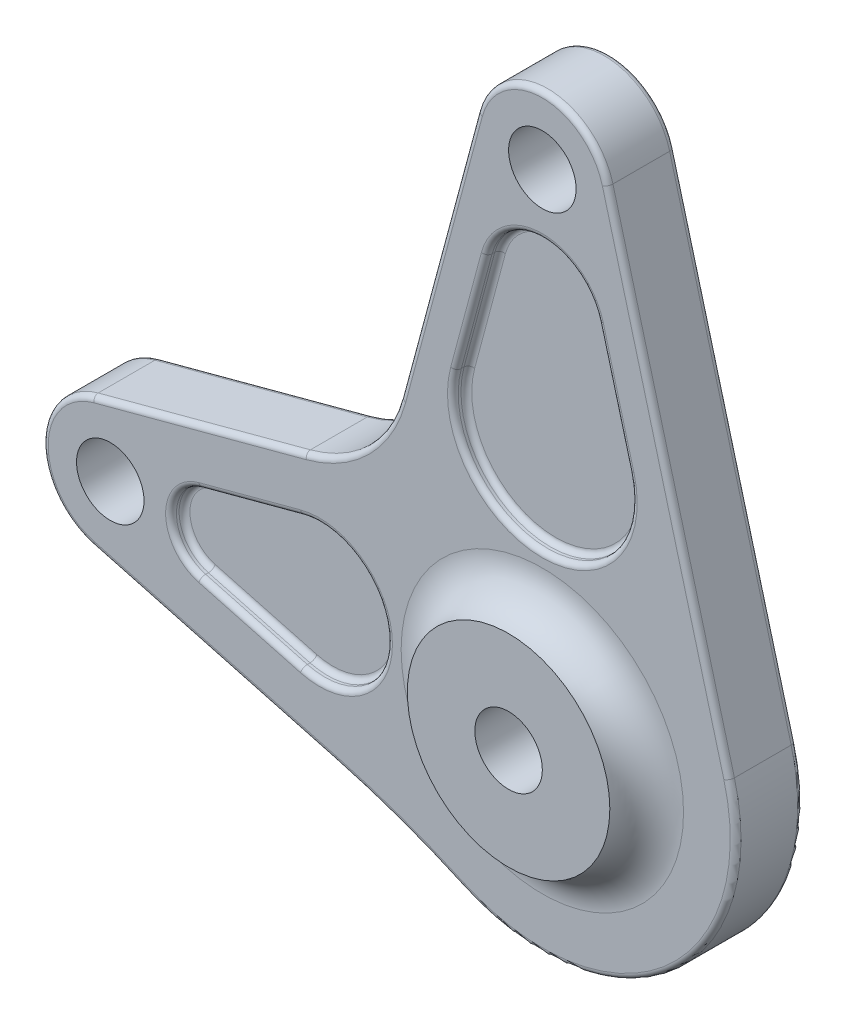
ISO-10303-21;
HEADER;
FILE_DESCRIPTION(('STEP AP214'),'2;1');
FILE_NAME('part.step','',(''),(''),'','','');
FILE_SCHEMA(('AUTOMOTIVE_DESIGN { 1 0 10303 214 1 1 1 1 }'));
ENDSEC;
DATA;
#1=APPLICATION_CONTEXT('core data for automotive mechanical design processes');
#2=APPLICATION_PROTOCOL_DEFINITION('international standard','automotive_design',2000,#1);
#3=PRODUCT_CONTEXT('',#1,'mechanical');
#4=PRODUCT('Part','Part','',(#3));
#5=PRODUCT_RELATED_PRODUCT_CATEGORY('part','',(#4));
#6=PRODUCT_DEFINITION_FORMATION('','',#4);
#7=PRODUCT_DEFINITION_CONTEXT('part definition',#1,'design');
#8=PRODUCT_DEFINITION('design','',#6,#7);
#9=PRODUCT_DEFINITION_SHAPE('','',#8);
#10=(LENGTH_UNIT() NAMED_UNIT(*) SI_UNIT(.MILLI.,.METRE.));
#11=(NAMED_UNIT(*) PLANE_ANGLE_UNIT() SI_UNIT($,.RADIAN.));
#12=(NAMED_UNIT(*) SI_UNIT($,.STERADIAN.) SOLID_ANGLE_UNIT());
#13=UNCERTAINTY_MEASURE_WITH_UNIT(LENGTH_MEASURE(1.E-05),#10,'distance_accuracy_value','');
#14=(GEOMETRIC_REPRESENTATION_CONTEXT(3) GLOBAL_UNCERTAINTY_ASSIGNED_CONTEXT((#13)) GLOBAL_UNIT_ASSIGNED_CONTEXT((#10,
#11,#12)) REPRESENTATION_CONTEXT('',''));
#15=CARTESIAN_POINT('',(0.,0.,0.));
#16=DIRECTION('',(0.,0.,1.));
#17=DIRECTION('',(1.,0.,0.));
#18=AXIS2_PLACEMENT_3D('',#15,#16,#17);
#19=CARTESIAN_POINT('',(-27.0325482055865,-237.328456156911,12.5));
#20=DIRECTION('',(0.,0.,1.));
#21=DIRECTION('',(1.,0.,0.));
#22=AXIS2_PLACEMENT_3D('',#19,#20,#21);
#23=PLANE('',#22);
#24=DIRECTION('',(-0.965925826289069,-0.258819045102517,0.));
#25=VECTOR('',#24,1.);
#26=CARTESIAN_POINT('',(-165.952838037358,22.2162940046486,12.5));
#27=LINE('',#26,#25);
#28=CARTESIAN_POINT('',(-87.3641343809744,43.2740736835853,12.5));
#29=VERTEX_POINT('',#28);
#30=CARTESIAN_POINT('',(-165.952838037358,22.2162940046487,12.5));
#31=VERTEX_POINT('',#30);
#32=EDGE_CURVE('E53',#29,#31,#27,.T.);
#33=ORIENTED_EDGE('',*,*,#32,.T.);
#34=CARTESIAN_POINT('',(-160.,0.,12.5));
#35=DIRECTION('',(0.,0.,1.));
#36=DIRECTION('',(1.,0.,0.));
#37=AXIS2_PLACEMENT_3D('',#34,#35,#36);
#38=CIRCLE('',#37,23.);
#39=CARTESIAN_POINT('',(-165.952838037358,-22.2162940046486,12.5));
#40=VERTEX_POINT('',#39);
#41=EDGE_CURVE('E519',#31,#40,#38,.T.);
#42=ORIENTED_EDGE('',*,*,#41,.T.);
#43=DIRECTION('',(0.965925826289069,-0.258819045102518,0.));
#44=VECTOR('',#43,1.);
#45=CARTESIAN_POINT('',(-76.3722205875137,-46.2193481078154,12.5));
#46=LINE('',#45,#44);
#47=CARTESIAN_POINT('',(-76.3722205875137,-46.2193481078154,12.5));
#48=VERTEX_POINT('',#47);
#49=EDGE_CURVE('E505',#40,#48,#46,.T.);
#50=ORIENTED_EDGE('',*,*,#49,.T.);
#51=CARTESIAN_POINT('',(-154.535572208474,-337.928947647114,12.5));
#52=DIRECTION('',(0.,0.,1.));
#53=DIRECTION('',(1.,0.,0.));
#54=AXIS2_PLACEMENT_3D('',#51,#52,#53);
#55=CIRCLE('',#54,302.);
#56=CARTESIAN_POINT('',(-28.9399807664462,-63.2841817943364,12.5));
#57=VERTEX_POINT('',#56);
#58=EDGE_CURVE('E507',#48,#57,#55,.F.);
#59=ORIENTED_EDGE('',*,*,#58,.T.);
#60=CARTESIAN_POINT('',(0.,0.,12.5));
#61=DIRECTION('',(0.,0.,1.));
#62=DIRECTION('',(1.,0.,0.));
#63=AXIS2_PLACEMENT_3D('',#60,#61,#62);
#64=CIRCLE('',#63,69.5874281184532);
#65=CARTESIAN_POINT('',(67.2162940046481,18.0105516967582,12.5));
#66=VERTEX_POINT('',#65);
#67=EDGE_CURVE('E509',#57,#66,#64,.T.);
#68=ORIENTED_EDGE('',*,*,#67,.T.);
#69=DIRECTION('',(-0.258819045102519,0.965925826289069,0.));
#70=VECTOR('',#69,1.);
#71=CARTESIAN_POINT('',(22.2162940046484,185.952838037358,12.5));
#72=LINE('',#71,#70);
#73=CARTESIAN_POINT('',(22.2162940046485,185.952838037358,12.5));
#74=VERTEX_POINT('',#73);
#75=EDGE_CURVE('E511',#66,#74,#72,.T.);
#76=ORIENTED_EDGE('',*,*,#75,.T.);
#77=CARTESIAN_POINT('',(1.11022302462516E-13,180.,12.5));
#78=DIRECTION('',(0.,0.,1.));
#79=DIRECTION('',(1.,0.,0.));
#80=AXIS2_PLACEMENT_3D('',#77,#78,#79);
#81=CIRCLE('',#80,22.9999999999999);
#82=CARTESIAN_POINT('',(-22.2162940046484,185.952838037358,12.5));
#83=VERTEX_POINT('',#82);
#84=EDGE_CURVE('E513',#74,#83,#81,.T.);
#85=ORIENTED_EDGE('',*,*,#84,.T.);
#86=DIRECTION('',(-0.258819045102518,-0.965925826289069,0.));
#87=VECTOR('',#86,1.);
#88=CARTESIAN_POINT('',(-50.5945817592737,80.0436263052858,12.5));
#89=LINE('',#88,#87);
#90=CARTESIAN_POINT('',(-50.5945817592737,80.0436263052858,12.5));
#91=VERTEX_POINT('',#90);
#92=EDGE_CURVE('E515',#83,#91,#89,.T.);
#93=ORIENTED_EDGE('',*,*,#92,.T.);
#94=CARTESIAN_POINT('',(-100.822724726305,93.5022166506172,12.5));
#95=DIRECTION('',(0.,0.,1.));
#96=DIRECTION('',(1.,0.,0.));
#97=AXIS2_PLACEMENT_3D('',#94,#95,#96);
#98=CIRCLE('',#97,52.0000000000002);
#99=EDGE_CURVE('E58',#91,#29,#98,.F.);
#100=ORIENTED_EDGE('',*,*,#99,.T.);
#101=EDGE_LOOP('',(#33,#42,#50,#59,#68,#76,#85,#93,#100));
#102=FACE_BOUND('',#101,.T.);
#103=CARTESIAN_POINT('',(0.,0.,12.5));
#104=DIRECTION('',(0.,0.,1.));
#105=DIRECTION('',(1.,0.,0.));
#106=AXIS2_PLACEMENT_3D('',#103,#104,#105);
#107=CIRCLE('',#106,52.290199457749);
#108=CARTESIAN_POINT('',(52.290199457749,0.,12.5));
#109=VERTEX_POINT('',#108);
#110=EDGE_CURVE('E448',#109,#109,#107,.F.);
#111=ORIENTED_EDGE('',*,*,#110,.T.);
#112=EDGE_LOOP('',(#111));
#113=FACE_BOUND('',#112,.T.);
#114=DIRECTION('',(-0.965925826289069,0.258819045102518,0.));
#115=VECTOR('',#114,1.);
#116=CARTESIAN_POINT('',(21.5807021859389,-55.9013357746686,12.5));
#117=LINE('',#116,#115);
#118=CARTESIAN_POINT('',(-89.5465902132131,-26.1248675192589,12.5));
#119=VERTEX_POINT('',#118);
#120=CARTESIAN_POINT('',(-127.194209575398,-16.0372183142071,12.5));
#121=VERTEX_POINT('',#120);
#122=EDGE_CURVE('E761',#119,#121,#117,.T.);
#123=ORIENTED_EDGE('',*,*,#122,.T.);
#124=CARTESIAN_POINT('',(-122.897049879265,0.,12.5));
#125=DIRECTION('',(0.,0.,1.));
#126=DIRECTION('',(1.,0.,0.));
#127=AXIS2_PLACEMENT_3D('',#124,#125,#126);
#128=CIRCLE('',#127,16.602950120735);
#129=CARTESIAN_POINT('',(-127.194209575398,16.0372183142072,12.5));
#130=VERTEX_POINT('',#129);
#131=EDGE_CURVE('E449',#121,#130,#128,.F.);
#132=ORIENTED_EDGE('',*,*,#131,.T.);
#133=DIRECTION('',(-0.965925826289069,-0.258819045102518,0.));
#134=VECTOR('',#133,1.);
#135=CARTESIAN_POINT('',(-89.5465902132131,26.1248675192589,12.5));
#136=LINE('',#135,#134);
#137=CARTESIAN_POINT('',(-89.5465902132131,26.1248675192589,12.5));
#138=VERTEX_POINT('',#137);
#139=EDGE_CURVE('E765',#130,#138,#136,.F.);
#140=ORIENTED_EDGE('',*,*,#139,.T.);
#141=CARTESIAN_POINT('',(-82.5464530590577,0.,12.5));
#142=DIRECTION('',(0.,0.,1.));
#143=DIRECTION('',(1.,0.,0.));
#144=AXIS2_PLACEMENT_3D('',#141,#142,#143);
#145=CIRCLE('',#144,27.0464530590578);
#146=EDGE_CURVE('E763',#138,#119,#145,.F.);
#147=ORIENTED_EDGE('',*,*,#146,.T.);
#148=EDGE_LOOP('',(#123,#132,#140,#147));
#149=FACE_BOUND('',#148,.T.);
#150=DIRECTION('',(0.258819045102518,0.965925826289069,0.));
#151=VECTOR('',#150,1.);
#152=CARTESIAN_POINT('',(-117.734061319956,-213.025058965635,12.5));
#153=LINE('',#152,#151);
#154=CARTESIAN_POINT('',(-33.9334792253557,99.7229711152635,12.5));
#155=VERTEX_POINT('',#154);
#156=CARTESIAN_POINT('',(-22.5533451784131,142.194209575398,12.5));
#157=VERTEX_POINT('',#156);
#158=EDGE_CURVE('E752',#155,#157,#153,.T.);
#159=ORIENTED_EDGE('',*,*,#158,.T.);
#160=CARTESIAN_POINT('',(0.,136.151058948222,12.5));
#161=DIRECTION('',(0.,0.,1.));
#162=DIRECTION('',(1.,0.,0.));
#163=AXIS2_PLACEMENT_3D('',#160,#161,#162);
#164=CIRCLE('',#163,23.3489410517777);
#165=CARTESIAN_POINT('',(22.5533451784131,142.194209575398,12.5));
#166=VERTEX_POINT('',#165);
#167=EDGE_CURVE('E758',#157,#166,#164,.F.);
#168=ORIENTED_EDGE('',*,*,#167,.T.);
#169=DIRECTION('',(-0.258819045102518,0.965925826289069,0.));
#170=VECTOR('',#169,1.);
#171=CARTESIAN_POINT('',(33.9334792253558,99.7229711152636,12.5));
#172=LINE('',#171,#170);
#173=CARTESIAN_POINT('',(33.9334792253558,99.7229711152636,12.5));
#174=VERTEX_POINT('',#173);
#175=EDGE_CURVE('E756',#166,#174,#172,.F.);
#176=ORIENTED_EDGE('',*,*,#175,.T.);
#177=CARTESIAN_POINT('',(0.,90.6305227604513,12.5));
#178=DIRECTION('',(0.,0.,1.));
#179=DIRECTION('',(1.,0.,0.));
#180=AXIS2_PLACEMENT_3D('',#177,#178,#179);
#181=CIRCLE('',#180,35.1305227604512);
#182=EDGE_CURVE('E754',#174,#155,#181,.F.);
#183=ORIENTED_EDGE('',*,*,#182,.T.);
#184=EDGE_LOOP('',(#159,#168,#176,#183));
#185=FACE_BOUND('',#184,.T.);
#186=CARTESIAN_POINT('',(-160.,0.,12.5));
#187=DIRECTION('',(0.,0.,1.));
#188=DIRECTION('',(1.,0.,0.));
#189=AXIS2_PLACEMENT_3D('',#186,#187,#188);
#190=CIRCLE('',#189,12.4999999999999);
#191=CARTESIAN_POINT('',(-147.5,0.,12.5));
#192=VERTEX_POINT('',#191);
#193=EDGE_CURVE('E607',#192,#192,#190,.T.);
#194=ORIENTED_EDGE('',*,*,#193,.F.);
#195=EDGE_LOOP('',(#194));
#196=FACE_BOUND('',#195,.T.);
#197=CARTESIAN_POINT('',(1.11022302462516E-13,180.,12.5));
#198=DIRECTION('',(0.,0.,1.));
#199=DIRECTION('',(1.,0.,0.));
#200=AXIS2_PLACEMENT_3D('',#197,#198,#199);
#201=CIRCLE('',#200,12.4999999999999);
#202=CARTESIAN_POINT('',(12.5,180.,12.5));
#203=VERTEX_POINT('',#202);
#204=EDGE_CURVE('E612',#203,#203,#201,.T.);
#205=ORIENTED_EDGE('',*,*,#204,.F.);
#206=EDGE_LOOP('',(#205));
#207=FACE_BOUND('',#206,.T.);
#208=ADVANCED_FACE('F36',(#102,#113,#149,#185,#196,#207),#23,.T.);
#209=CARTESIAN_POINT('',(-27.0325482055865,-237.328456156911,-12.5));
#210=DIRECTION('',(0.,0.,1.));
#211=DIRECTION('',(1.,0.,0.));
#212=AXIS2_PLACEMENT_3D('',#209,#210,#211);
#213=PLANE('',#212);
#214=DIRECTION('',(0.965925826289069,-0.258819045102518,0.));
#215=VECTOR('',#214,1.);
#216=CARTESIAN_POINT('',(17.4395974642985,-71.3561489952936,-12.5));
#217=LINE('',#216,#215);
#218=CARTESIAN_POINT('',(-76.3722205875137,-46.2193481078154,-12.5));
#219=VERTEX_POINT('',#218);
#220=CARTESIAN_POINT('',(-165.952838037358,-22.2162940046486,-12.5));
#221=VERTEX_POINT('',#220);
#222=EDGE_CURVE('E458',#219,#221,#217,.F.);
#223=ORIENTED_EDGE('',*,*,#222,.T.);
#224=CARTESIAN_POINT('',(-160.,0.,-12.5));
#225=DIRECTION('',(0.,0.,1.));
#226=DIRECTION('',(1.,0.,0.));
#227=AXIS2_PLACEMENT_3D('',#224,#225,#226);
#228=CIRCLE('',#227,23.);
#229=CARTESIAN_POINT('',(-165.952838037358,22.2162940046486,-12.5));
#230=VERTEX_POINT('',#229);
#231=EDGE_CURVE('E474',#221,#230,#228,.F.);
#232=ORIENTED_EDGE('',*,*,#231,.T.);
#233=DIRECTION('',(-0.965925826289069,-0.258819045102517,0.));
#234=VECTOR('',#233,1.);
#235=CARTESIAN_POINT('',(-101.224630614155,39.5601649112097,-12.5));
#236=LINE('',#235,#234);
#237=CARTESIAN_POINT('',(-87.3641343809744,43.2740736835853,-12.5));
#238=VERTEX_POINT('',#237);
#239=EDGE_CURVE('E472',#230,#238,#236,.F.);
#240=ORIENTED_EDGE('',*,*,#239,.T.);
#241=CARTESIAN_POINT('',(-100.822724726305,93.5022166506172,-12.5));
#242=DIRECTION('',(0.,0.,1.));
#243=DIRECTION('',(1.,0.,0.));
#244=AXIS2_PLACEMENT_3D('',#241,#242,#243);
#245=CIRCLE('',#244,52.0000000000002);
#246=CARTESIAN_POINT('',(-50.5945817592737,80.0436263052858,-12.5));
#247=VERTEX_POINT('',#246);
#248=EDGE_CURVE('E470',#238,#247,#245,.T.);
#249=ORIENTED_EDGE('',*,*,#248,.T.);
#250=DIRECTION('',(-0.258819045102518,-0.965925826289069,0.));
#251=VECTOR('',#250,1.);
#252=CARTESIAN_POINT('',(-128.359245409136,-210.178049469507,-12.5));
#253=LINE('',#252,#251);
#254=CARTESIAN_POINT('',(-22.2162940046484,185.952838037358,-12.5));
#255=VERTEX_POINT('',#254);
#256=EDGE_CURVE('E468',#247,#255,#253,.F.);
#257=ORIENTED_EDGE('',*,*,#256,.T.);
#258=CARTESIAN_POINT('',(1.11022302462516E-13,180.,-12.5));
#259=DIRECTION('',(0.,0.,1.));
#260=DIRECTION('',(1.,0.,0.));
#261=AXIS2_PLACEMENT_3D('',#258,#259,#260);
#262=CIRCLE('',#261,22.9999999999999);
#263=CARTESIAN_POINT('',(22.2162940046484,185.952838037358,-12.5));
#264=VERTEX_POINT('',#263);
#265=EDGE_CURVE('E466',#255,#264,#262,.F.);
#266=ORIENTED_EDGE('',*,*,#265,.T.);
#267=DIRECTION('',(-0.258819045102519,0.965925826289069,0.));
#268=VECTOR('',#267,1.);
#269=CARTESIAN_POINT('',(124.737570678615,-196.661775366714,-12.5));
#270=LINE('',#269,#268);
#271=CARTESIAN_POINT('',(67.2162940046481,18.0105516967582,-12.5));
#272=VERTEX_POINT('',#271);
#273=EDGE_CURVE('E464',#264,#272,#270,.F.);
#274=ORIENTED_EDGE('',*,*,#273,.T.);
#275=CARTESIAN_POINT('',(0.,0.,-12.5));
#276=DIRECTION('',(0.,0.,1.));
#277=DIRECTION('',(1.,0.,0.));
#278=AXIS2_PLACEMENT_3D('',#275,#276,#277);
#279=CIRCLE('',#278,69.5874281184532);
#280=CARTESIAN_POINT('',(-28.9399807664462,-63.2841817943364,-12.5));
#281=VERTEX_POINT('',#280);
#282=EDGE_CURVE('E462',#272,#281,#279,.F.);
#283=ORIENTED_EDGE('',*,*,#282,.T.);
#284=CARTESIAN_POINT('',(-154.535572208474,-337.928947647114,-12.5));
#285=DIRECTION('',(0.,0.,1.));
#286=DIRECTION('',(1.,0.,0.));
#287=AXIS2_PLACEMENT_3D('',#284,#285,#286);
#288=CIRCLE('',#287,302.);
#289=EDGE_CURVE('E460',#281,#219,#288,.T.);
#290=ORIENTED_EDGE('',*,*,#289,.T.);
#291=EDGE_LOOP('',(#223,#232,#240,#249,#257,#266,#274,#283,#290));
#292=FACE_BOUND('',#291,.T.);
#293=CARTESIAN_POINT('',(0.,0.,-12.5));
#294=DIRECTION('',(0.,0.,1.));
#295=DIRECTION('',(1.,0.,0.));
#296=AXIS2_PLACEMENT_3D('',#293,#294,#295);
#297=CIRCLE('',#296,52.290199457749);
#298=CARTESIAN_POINT('',(52.290199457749,0.,-12.5));
#299=VERTEX_POINT('',#298);
#300=EDGE_CURVE('E445',#299,#299,#297,.T.);
#301=ORIENTED_EDGE('',*,*,#300,.T.);
#302=EDGE_LOOP('',(#301));
#303=FACE_BOUND('',#302,.T.);
#304=DIRECTION('',(0.965925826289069,-0.258819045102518,0.));
#305=VECTOR('',#304,1.);
#306=CARTESIAN_POINT('',(21.5807021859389,-55.9013357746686,-12.5));
#307=LINE('',#306,#305);
#308=CARTESIAN_POINT('',(-127.194209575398,-16.0372183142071,-12.5));
#309=VERTEX_POINT('',#308);
#310=CARTESIAN_POINT('',(-89.5465902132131,-26.1248675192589,-12.5));
#311=VERTEX_POINT('',#310);
#312=EDGE_CURVE('E689',#309,#311,#307,.T.);
#313=ORIENTED_EDGE('',*,*,#312,.T.);
#314=CARTESIAN_POINT('',(-82.5464530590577,0.,-12.5));
#315=DIRECTION('',(0.,0.,1.));
#316=DIRECTION('',(1.,0.,0.));
#317=AXIS2_PLACEMENT_3D('',#314,#315,#316);
#318=CIRCLE('',#317,27.0464530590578);
#319=CARTESIAN_POINT('',(-89.5465902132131,26.1248675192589,-12.5));
#320=VERTEX_POINT('',#319);
#321=EDGE_CURVE('E695',#311,#320,#318,.T.);
#322=ORIENTED_EDGE('',*,*,#321,.T.);
#323=DIRECTION('',(0.965925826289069,0.258819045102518,0.));
#324=VECTOR('',#323,1.);
#325=CARTESIAN_POINT('',(-127.194209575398,16.0372183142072,-12.5));
#326=LINE('',#325,#324);
#327=CARTESIAN_POINT('',(-127.194209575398,16.0372183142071,-12.5));
#328=VERTEX_POINT('',#327);
#329=EDGE_CURVE('E693',#320,#328,#326,.F.);
#330=ORIENTED_EDGE('',*,*,#329,.T.);
#331=CARTESIAN_POINT('',(-122.897049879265,0.,-12.5));
#332=DIRECTION('',(0.,0.,1.));
#333=DIRECTION('',(1.,0.,0.));
#334=AXIS2_PLACEMENT_3D('',#331,#332,#333);
#335=CIRCLE('',#334,16.602950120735);
#336=EDGE_CURVE('E691',#328,#309,#335,.T.);
#337=ORIENTED_EDGE('',*,*,#336,.T.);
#338=EDGE_LOOP('',(#313,#322,#330,#337));
#339=FACE_BOUND('',#338,.T.);
#340=DIRECTION('',(-0.258819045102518,-0.965925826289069,0.));
#341=VECTOR('',#340,1.);
#342=CARTESIAN_POINT('',(-117.734061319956,-213.025058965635,-12.5));
#343=LINE('',#342,#341);
#344=CARTESIAN_POINT('',(-22.5533451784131,142.194209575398,-12.5));
#345=VERTEX_POINT('',#344);
#346=CARTESIAN_POINT('',(-33.9334792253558,99.7229711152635,-12.5));
#347=VERTEX_POINT('',#346);
#348=EDGE_CURVE('E394',#345,#347,#343,.T.);
#349=ORIENTED_EDGE('',*,*,#348,.T.);
#350=CARTESIAN_POINT('',(0.,90.6305227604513,-12.5));
#351=DIRECTION('',(0.,0.,1.));
#352=DIRECTION('',(1.,0.,0.));
#353=AXIS2_PLACEMENT_3D('',#350,#351,#352);
#354=CIRCLE('',#353,35.1305227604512);
#355=CARTESIAN_POINT('',(33.9334792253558,99.7229711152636,-12.5));
#356=VERTEX_POINT('',#355);
#357=EDGE_CURVE('E686',#347,#356,#354,.T.);
#358=ORIENTED_EDGE('',*,*,#357,.T.);
#359=DIRECTION('',(0.258819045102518,-0.965925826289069,0.));
#360=VECTOR('',#359,1.);
#361=CARTESIAN_POINT('',(22.5533451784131,142.194209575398,-12.5));
#362=LINE('',#361,#360);
#363=CARTESIAN_POINT('',(22.5533451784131,142.194209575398,-12.5));
#364=VERTEX_POINT('',#363);
#365=EDGE_CURVE('E684',#356,#364,#362,.F.);
#366=ORIENTED_EDGE('',*,*,#365,.T.);
#367=CARTESIAN_POINT('',(0.,136.151058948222,-12.5));
#368=DIRECTION('',(0.,0.,1.));
#369=DIRECTION('',(1.,0.,0.));
#370=AXIS2_PLACEMENT_3D('',#367,#368,#369);
#371=CIRCLE('',#370,23.3489410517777);
#372=EDGE_CURVE('E682',#364,#345,#371,.T.);
#373=ORIENTED_EDGE('',*,*,#372,.T.);
#374=EDGE_LOOP('',(#349,#358,#366,#373));
#375=FACE_BOUND('',#374,.T.);
#376=CARTESIAN_POINT('',(-160.,0.,-12.5));
#377=DIRECTION('',(0.,0.,1.));
#378=DIRECTION('',(1.,0.,0.));
#379=AXIS2_PLACEMENT_3D('',#376,#377,#378);
#380=CIRCLE('',#379,12.4999999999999);
#381=CARTESIAN_POINT('',(-147.5,0.,-12.5));
#382=VERTEX_POINT('',#381);
#383=EDGE_CURVE('E615',#382,#382,#380,.T.);
#384=ORIENTED_EDGE('',*,*,#383,.T.);
#385=EDGE_LOOP('',(#384));
#386=FACE_BOUND('',#385,.T.);
#387=CARTESIAN_POINT('',(1.11022302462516E-13,180.,-12.5));
#388=DIRECTION('',(0.,0.,1.));
#389=DIRECTION('',(1.,0.,0.));
#390=AXIS2_PLACEMENT_3D('',#387,#388,#389);
#391=CIRCLE('',#390,12.4999999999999);
#392=CARTESIAN_POINT('',(12.5,180.,-12.5));
#393=VERTEX_POINT('',#392);
#394=EDGE_CURVE('E863',#393,#393,#391,.T.);
#395=ORIENTED_EDGE('',*,*,#394,.T.);
#396=EDGE_LOOP('',(#395));
#397=FACE_BOUND('',#396,.T.);
#398=ADVANCED_FACE('F803',(#292,#303,#339,#375,#386,#397),#213,.F.);
#399=CARTESIAN_POINT('',(-154.535572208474,-337.928947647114,12.5));
#400=DIRECTION('',(0.,0.,-1.));
#401=DIRECTION('',(-1.,0.,0.));
#402=AXIS2_PLACEMENT_3D('',#399,#400,#401);
#403=CYLINDRICAL_SURFACE('',#402,300.);
#404=DIRECTION('',(0.,0.,-1.));
#405=VECTOR('',#404,1.);
#406=CARTESIAN_POINT('',(-76.8898586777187,-48.1511997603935,12.5));
#407=LINE('',#406,#405);
#408=CARTESIAN_POINT('',(-76.8898586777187,-48.1511997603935,10.5));
#409=VERTEX_POINT('',#408);
#410=CARTESIAN_POINT('',(-76.8898586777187,-48.1511997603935,-10.5));
#411=VERTEX_POINT('',#410);
#412=EDGE_CURVE('E598',#409,#411,#407,.T.);
#413=ORIENTED_EDGE('',*,*,#412,.T.);
#414=CARTESIAN_POINT('',(-154.535572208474,-337.928947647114,-10.5));
#415=DIRECTION('',(0.,0.,1.));
#416=DIRECTION('',(1.,0.,0.));
#417=AXIS2_PLACEMENT_3D('',#414,#415,#416);
#418=CIRCLE('',#417,300.);
#419=CARTESIAN_POINT('',(-29.7717396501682,-65.1030213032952,-10.5));
#420=VERTEX_POINT('',#419);
#421=EDGE_CURVE('E503',#411,#420,#418,.F.);
#422=ORIENTED_EDGE('',*,*,#421,.T.);
#423=DIRECTION('',(0.,0.,-1.));
#424=VECTOR('',#423,1.);
#425=CARTESIAN_POINT('',(-29.7717396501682,-65.1030213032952,12.5));
#426=LINE('',#425,#424);
#427=CARTESIAN_POINT('',(-29.7717396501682,-65.1030213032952,10.5));
#428=VERTEX_POINT('',#427);
#429=EDGE_CURVE('E368',#428,#420,#426,.T.);
#430=ORIENTED_EDGE('',*,*,#429,.F.);
#431=CARTESIAN_POINT('',(-154.535572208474,-337.928947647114,10.5));
#432=DIRECTION('',(0.,0.,1.));
#433=DIRECTION('',(1.,0.,0.));
#434=AXIS2_PLACEMENT_3D('',#431,#432,#433);
#435=CIRCLE('',#434,300.);
#436=EDGE_CURVE('E501',#428,#409,#435,.T.);
#437=ORIENTED_EDGE('',*,*,#436,.T.);
#438=EDGE_LOOP('',(#413,#422,#430,#437));
#439=FACE_BOUND('',#438,.T.);
#440=ADVANCED_FACE('F597',(#439),#403,.F.);
#441=CARTESIAN_POINT('',(0.,0.,12.5));
#442=DIRECTION('',(0.,0.,-1.));
#443=DIRECTION('',(-1.,0.,0.));
#444=AXIS2_PLACEMENT_3D('',#441,#442,#443);
#445=CYLINDRICAL_SURFACE('',#444,71.5874281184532);
#446=ORIENTED_EDGE('',*,*,#429,.T.);
#447=CARTESIAN_POINT('',(0.,0.,-10.5));
#448=DIRECTION('',(0.,0.,1.));
#449=DIRECTION('',(1.,0.,0.));
#450=AXIS2_PLACEMENT_3D('',#447,#448,#449);
#451=CIRCLE('',#450,71.5874281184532);
#452=CARTESIAN_POINT('',(69.1481456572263,18.5281897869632,-10.5));
#453=VERTEX_POINT('',#452);
#454=EDGE_CURVE('E499',#420,#453,#451,.T.);
#455=ORIENTED_EDGE('',*,*,#454,.T.);
#456=DIRECTION('',(0.,0.,-1.));
#457=VECTOR('',#456,1.);
#458=CARTESIAN_POINT('',(69.1481456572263,18.5281897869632,12.5));
#459=LINE('',#458,#457);
#460=CARTESIAN_POINT('',(69.1481456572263,18.5281897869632,10.5));
#461=VERTEX_POINT('',#460);
#462=EDGE_CURVE('E632',#461,#453,#459,.T.);
#463=ORIENTED_EDGE('',*,*,#462,.F.);
#464=CARTESIAN_POINT('',(0.,0.,10.5));
#465=DIRECTION('',(0.,0.,1.));
#466=DIRECTION('',(1.,0.,0.));
#467=AXIS2_PLACEMENT_3D('',#464,#465,#466);
#468=CIRCLE('',#467,71.5874281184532);
#469=EDGE_CURVE('E497',#461,#428,#468,.F.);
#470=ORIENTED_EDGE('',*,*,#469,.T.);
#471=EDGE_LOOP('',(#446,#455,#463,#470));
#472=FACE_BOUND('',#471,.T.);
#473=ADVANCED_FACE('F927',(#472),#445,.T.);
#474=CARTESIAN_POINT('',(126.669422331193,-196.144137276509,12.5));
#475=DIRECTION('',(-0.965925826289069,-0.258819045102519,0.));
#476=DIRECTION('',(0.258819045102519,-0.965925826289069,0.));
#477=AXIS2_PLACEMENT_3D('',#474,#475,#476);
#478=PLANE('',#477);
#479=ORIENTED_EDGE('',*,*,#462,.T.);
#480=DIRECTION('',(-0.258819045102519,0.965925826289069,0.));
#481=VECTOR('',#480,1.);
#482=CARTESIAN_POINT('',(126.669422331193,-196.144137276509,-10.5));
#483=LINE('',#482,#481);
#484=CARTESIAN_POINT('',(24.1481456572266,186.470476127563,-10.5));
#485=VERTEX_POINT('',#484);
#486=EDGE_CURVE('E495',#453,#485,#483,.T.);
#487=ORIENTED_EDGE('',*,*,#486,.T.);
#488=DIRECTION('',(0.,0.,-1.));
#489=VECTOR('',#488,1.);
#490=CARTESIAN_POINT('',(24.1481456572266,186.470476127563,12.5));
#491=LINE('',#490,#489);
#492=CARTESIAN_POINT('',(24.1481456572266,186.470476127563,10.5));
#493=VERTEX_POINT('',#492);
#494=EDGE_CURVE('E629',#493,#485,#491,.T.);
#495=ORIENTED_EDGE('',*,*,#494,.F.);
#496=DIRECTION('',(-0.258819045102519,0.965925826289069,0.));
#497=VECTOR('',#496,1.);
#498=CARTESIAN_POINT('',(69.1481456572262,18.5281897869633,10.5));
#499=LINE('',#498,#497);
#500=EDGE_CURVE('E493',#493,#461,#499,.F.);
#501=ORIENTED_EDGE('',*,*,#500,.T.);
#502=EDGE_LOOP('',(#479,#487,#495,#501));
#503=FACE_BOUND('',#502,.T.);
#504=ADVANCED_FACE('F923',(#503),#478,.F.);
#505=CARTESIAN_POINT('',(1.11022302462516E-13,180.,12.5));
#506=DIRECTION('',(0.,0.,-1.));
#507=DIRECTION('',(-1.,0.,0.));
#508=AXIS2_PLACEMENT_3D('',#505,#506,#507);
#509=CYLINDRICAL_SURFACE('',#508,24.9999999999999);
#510=ORIENTED_EDGE('',*,*,#494,.T.);
#511=CARTESIAN_POINT('',(1.11022302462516E-13,180.,-10.5));
#512=DIRECTION('',(0.,0.,1.));
#513=DIRECTION('',(1.,0.,0.));
#514=AXIS2_PLACEMENT_3D('',#511,#512,#513);
#515=CIRCLE('',#514,24.9999999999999);
#516=CARTESIAN_POINT('',(-24.1481456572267,186.470476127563,-10.5));
#517=VERTEX_POINT('',#516);
#518=EDGE_CURVE('E491',#485,#517,#515,.T.);
#519=ORIENTED_EDGE('',*,*,#518,.T.);
#520=DIRECTION('',(0.,0.,-1.));
#521=VECTOR('',#520,1.);
#522=CARTESIAN_POINT('',(-24.1481456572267,186.470476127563,12.5));
#523=LINE('',#522,#521);
#524=CARTESIAN_POINT('',(-24.1481456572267,186.470476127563,10.5));
#525=VERTEX_POINT('',#524);
#526=EDGE_CURVE('E626',#525,#517,#523,.T.);
#527=ORIENTED_EDGE('',*,*,#526,.F.);
#528=CARTESIAN_POINT('',(1.11022302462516E-13,180.,10.5));
#529=DIRECTION('',(0.,0.,1.));
#530=DIRECTION('',(1.,0.,0.));
#531=AXIS2_PLACEMENT_3D('',#528,#529,#530);
#532=CIRCLE('',#531,24.9999999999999);
#533=EDGE_CURVE('E489',#525,#493,#532,.F.);
#534=ORIENTED_EDGE('',*,*,#533,.T.);
#535=EDGE_LOOP('',(#510,#519,#527,#534));
#536=FACE_BOUND('',#535,.T.);
#537=ADVANCED_FACE('F919',(#536),#509,.T.);
#538=CARTESIAN_POINT('',(-130.291097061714,-209.660411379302,12.5));
#539=DIRECTION('',(0.965925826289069,-0.258819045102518,0.));
#540=DIRECTION('',(0.258819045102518,0.965925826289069,0.));
#541=AXIS2_PLACEMENT_3D('',#538,#539,#540);
#542=PLANE('',#541);
#543=ORIENTED_EDGE('',*,*,#526,.T.);
#544=DIRECTION('',(-0.258819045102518,-0.965925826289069,0.));
#545=VECTOR('',#544,1.);
#546=CARTESIAN_POINT('',(-130.291097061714,-209.660411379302,-10.5));
#547=LINE('',#546,#545);
#548=CARTESIAN_POINT('',(-52.5264334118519,80.5612643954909,-10.5));
#549=VERTEX_POINT('',#548);
#550=EDGE_CURVE('E487',#517,#549,#547,.T.);
#551=ORIENTED_EDGE('',*,*,#550,.T.);
#552=DIRECTION('',(0.,0.,-1.));
#553=VECTOR('',#552,1.);
#554=CARTESIAN_POINT('',(-52.5264334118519,80.5612643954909,12.5));
#555=LINE('',#554,#553);
#556=CARTESIAN_POINT('',(-52.5264334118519,80.5612643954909,10.5));
#557=VERTEX_POINT('',#556);
#558=EDGE_CURVE('E623',#557,#549,#555,.T.);
#559=ORIENTED_EDGE('',*,*,#558,.F.);
#560=DIRECTION('',(-0.258819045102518,-0.965925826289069,0.));
#561=VECTOR('',#560,1.);
#562=CARTESIAN_POINT('',(-24.1481456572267,186.470476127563,10.5));
#563=LINE('',#562,#561);
#564=EDGE_CURVE('E485',#557,#525,#563,.F.);
#565=ORIENTED_EDGE('',*,*,#564,.T.);
#566=EDGE_LOOP('',(#543,#551,#559,#565));
#567=FACE_BOUND('',#566,.T.);
#568=ADVANCED_FACE('F915',(#567),#542,.F.);
#569=CARTESIAN_POINT('',(-100.822724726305,93.5022166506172,12.5));
#570=DIRECTION('',(0.,0.,-1.));
#571=DIRECTION('',(-1.,0.,0.));
#572=AXIS2_PLACEMENT_3D('',#569,#570,#571);
#573=CYLINDRICAL_SURFACE('',#572,50.0000000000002);
#574=ORIENTED_EDGE('',*,*,#558,.T.);
#575=CARTESIAN_POINT('',(-100.822724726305,93.5022166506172,-10.5));
#576=DIRECTION('',(0.,0.,1.));
#577=DIRECTION('',(1.,0.,0.));
#578=AXIS2_PLACEMENT_3D('',#575,#576,#577);
#579=CIRCLE('',#578,50.0000000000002);
#580=CARTESIAN_POINT('',(-87.8817724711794,45.2059253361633,-10.5));
#581=VERTEX_POINT('',#580);
#582=EDGE_CURVE('E483',#549,#581,#579,.F.);
#583=ORIENTED_EDGE('',*,*,#582,.T.);
#584=DIRECTION('',(0.,0.,-1.));
#585=VECTOR('',#584,1.);
#586=CARTESIAN_POINT('',(-87.8817724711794,45.2059253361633,12.5));
#587=LINE('',#586,#585);
#588=CARTESIAN_POINT('',(-87.8817724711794,45.2059253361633,10.5));
#589=VERTEX_POINT('',#588);
#590=EDGE_CURVE('E620',#589,#581,#587,.T.);
#591=ORIENTED_EDGE('',*,*,#590,.F.);
#592=CARTESIAN_POINT('',(-100.822724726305,93.5022166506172,10.5));
#593=DIRECTION('',(0.,0.,1.));
#594=DIRECTION('',(1.,0.,0.));
#595=AXIS2_PLACEMENT_3D('',#592,#593,#594);
#596=CIRCLE('',#595,50.0000000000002);
#597=EDGE_CURVE('E481',#589,#557,#596,.T.);
#598=ORIENTED_EDGE('',*,*,#597,.T.);
#599=EDGE_LOOP('',(#574,#583,#591,#598));
#600=FACE_BOUND('',#599,.T.);
#601=ADVANCED_FACE('F911',(#600),#573,.F.);
#602=CARTESIAN_POINT('',(-101.74226870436,41.4920165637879,12.5));
#603=DIRECTION('',(0.258819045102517,-0.965925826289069,0.));
#604=DIRECTION('',(0.965925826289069,0.258819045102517,0.));
#605=AXIS2_PLACEMENT_3D('',#602,#603,#604);
#606=PLANE('',#605);
#607=ORIENTED_EDGE('',*,*,#590,.T.);
#608=DIRECTION('',(-0.965925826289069,-0.258819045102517,0.));
#609=VECTOR('',#608,1.);
#610=CARTESIAN_POINT('',(-101.74226870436,41.4920165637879,-10.5));
#611=LINE('',#610,#609);
#612=CARTESIAN_POINT('',(-166.470476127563,24.1481456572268,-10.5));
#613=VERTEX_POINT('',#612);
#614=EDGE_CURVE('E479',#581,#613,#611,.T.);
#615=ORIENTED_EDGE('',*,*,#614,.T.);
#616=DIRECTION('',(0.,0.,-1.));
#617=VECTOR('',#616,1.);
#618=CARTESIAN_POINT('',(-166.470476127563,24.1481456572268,12.5));
#619=LINE('',#618,#617);
#620=CARTESIAN_POINT('',(-166.470476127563,24.1481456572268,10.5));
#621=VERTEX_POINT('',#620);
#622=EDGE_CURVE('E609',#621,#613,#619,.T.);
#623=ORIENTED_EDGE('',*,*,#622,.F.);
#624=DIRECTION('',(-0.965925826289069,-0.258819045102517,0.));
#625=VECTOR('',#624,1.);
#626=CARTESIAN_POINT('',(-87.8817724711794,45.2059253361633,10.5));
#627=LINE('',#626,#625);
#628=EDGE_CURVE('E477',#621,#589,#627,.F.);
#629=ORIENTED_EDGE('',*,*,#628,.T.);
#630=EDGE_LOOP('',(#607,#615,#623,#629));
#631=FACE_BOUND('',#630,.T.);
#632=ADVANCED_FACE('F907',(#631),#606,.F.);
#633=CARTESIAN_POINT('',(-160.,0.,12.5));
#634=DIRECTION('',(0.,0.,-1.));
#635=DIRECTION('',(-1.,0.,0.));
#636=AXIS2_PLACEMENT_3D('',#633,#634,#635);
#637=CYLINDRICAL_SURFACE('',#636,25.);
#638=ORIENTED_EDGE('',*,*,#622,.T.);
#639=CARTESIAN_POINT('',(-160.,0.,-10.5));
#640=DIRECTION('',(0.,0.,1.));
#641=DIRECTION('',(1.,0.,0.));
#642=AXIS2_PLACEMENT_3D('',#639,#640,#641);
#643=CIRCLE('',#642,25.);
#644=CARTESIAN_POINT('',(-166.470476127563,-24.1481456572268,-10.5));
#645=VERTEX_POINT('',#644);
#646=EDGE_CURVE('E455',#613,#645,#643,.T.);
#647=ORIENTED_EDGE('',*,*,#646,.T.);
#648=DIRECTION('',(0.,0.,-1.));
#649=VECTOR('',#648,1.);
#650=CARTESIAN_POINT('',(-166.470476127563,-24.1481456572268,12.5));
#651=LINE('',#650,#649);
#652=CARTESIAN_POINT('',(-166.470476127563,-24.1481456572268,10.5));
#653=VERTEX_POINT('',#652);
#654=EDGE_CURVE('E606',#653,#645,#651,.T.);
#655=ORIENTED_EDGE('',*,*,#654,.F.);
#656=CARTESIAN_POINT('',(-160.,0.,10.5));
#657=DIRECTION('',(0.,0.,1.));
#658=DIRECTION('',(1.,0.,0.));
#659=AXIS2_PLACEMENT_3D('',#656,#657,#658);
#660=CIRCLE('',#659,25.);
#661=EDGE_CURVE('E452',#653,#621,#660,.F.);
#662=ORIENTED_EDGE('',*,*,#661,.T.);
#663=EDGE_LOOP('',(#638,#647,#655,#662));
#664=FACE_BOUND('',#663,.T.);
#665=ADVANCED_FACE('F887',(#664),#637,.T.);
#666=CARTESIAN_POINT('',(16.9219593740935,-73.2880006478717,12.5));
#667=DIRECTION('',(0.258819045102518,0.965925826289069,0.));
#668=DIRECTION('',(-0.965925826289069,0.258819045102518,0.));
#669=AXIS2_PLACEMENT_3D('',#666,#667,#668);
#670=PLANE('',#669);
#671=ORIENTED_EDGE('',*,*,#654,.T.);
#672=DIRECTION('',(0.965925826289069,-0.258819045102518,0.));
#673=VECTOR('',#672,1.);
#674=CARTESIAN_POINT('',(16.9219593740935,-73.2880006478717,-10.5));
#675=LINE('',#674,#673);
#676=EDGE_CURVE('E11',#645,#411,#675,.T.);
#677=ORIENTED_EDGE('',*,*,#676,.T.);
#678=ORIENTED_EDGE('',*,*,#412,.F.);
#679=DIRECTION('',(0.965925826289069,-0.258819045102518,0.));
#680=VECTOR('',#679,1.);
#681=CARTESIAN_POINT('',(-166.470476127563,-24.1481456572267,10.5));
#682=LINE('',#681,#680);
#683=EDGE_CURVE('E45',#409,#653,#682,.F.);
#684=ORIENTED_EDGE('',*,*,#683,.T.);
#685=EDGE_LOOP('',(#671,#677,#678,#684));
#686=FACE_BOUND('',#685,.T.);
#687=ADVANCED_FACE('F603',(#686),#670,.F.);
#688=CARTESIAN_POINT('',(-160.,0.,12.5));
#689=DIRECTION('',(0.,0.,-1.));
#690=DIRECTION('',(-1.,0.,0.));
#691=AXIS2_PLACEMENT_3D('',#688,#689,#690);
#692=CYLINDRICAL_SURFACE('',#691,12.4999999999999);
#693=ORIENTED_EDGE('',*,*,#193,.T.);
#694=EDGE_LOOP('',(#693));
#695=FACE_BOUND('',#694,.T.);
#696=ORIENTED_EDGE('',*,*,#383,.F.);
#697=EDGE_LOOP('',(#696));
#698=FACE_BOUND('',#697,.T.);
#699=ADVANCED_FACE('F875',(#695,#698),#692,.F.);
#700=CARTESIAN_POINT('',(1.11022302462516E-13,180.,12.5));
#701=DIRECTION('',(0.,0.,-1.));
#702=DIRECTION('',(-1.,0.,0.));
#703=AXIS2_PLACEMENT_3D('',#700,#701,#702);
#704=CYLINDRICAL_SURFACE('',#703,12.4999999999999);
#705=ORIENTED_EDGE('',*,*,#204,.T.);
#706=EDGE_LOOP('',(#705));
#707=FACE_BOUND('',#706,.T.);
#708=ORIENTED_EDGE('',*,*,#394,.F.);
#709=EDGE_LOOP('',(#708));
#710=FACE_BOUND('',#709,.T.);
#711=ADVANCED_FACE('F877',(#707,#710),#704,.F.);
#712=CARTESIAN_POINT('',(-27.0325482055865,-237.328456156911,-25.));
#713=DIRECTION('',(0.,0.,1.));
#714=DIRECTION('',(1.,0.,0.));
#715=AXIS2_PLACEMENT_3D('',#712,#713,#714);
#716=PLANE('',#715);
#717=CARTESIAN_POINT('',(0.,0.,-25.));
#718=DIRECTION('',(0.,0.,1.));
#719=DIRECTION('',(1.,0.,0.));
#720=AXIS2_PLACEMENT_3D('',#717,#718,#719);
#721=CIRCLE('',#720,12.4999999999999);
#722=CARTESIAN_POINT('',(12.4999999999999,0.,-25.));
#723=VERTEX_POINT('',#722);
#724=EDGE_CURVE('E855',#723,#723,#721,.T.);
#725=ORIENTED_EDGE('',*,*,#724,.T.);
#726=EDGE_LOOP('',(#725));
#727=FACE_BOUND('',#726,.T.);
#728=CARTESIAN_POINT('',(0.,0.,-25.));
#729=DIRECTION('',(0.,0.,1.));
#730=DIRECTION('',(1.,0.,0.));
#731=AXIS2_PLACEMENT_3D('',#728,#729,#730);
#732=CIRCLE('',#731,37.5);
#733=CARTESIAN_POINT('',(37.5,0.,-25.));
#734=VERTEX_POINT('',#733);
#735=EDGE_CURVE('E860',#734,#734,#732,.T.);
#736=ORIENTED_EDGE('',*,*,#735,.F.);
#737=EDGE_LOOP('',(#736));
#738=FACE_BOUND('',#737,.T.);
#739=ADVANCED_FACE('F884',(#727,#738),#716,.F.);
#740=CARTESIAN_POINT('',(0.,0.,12.5));
#741=DIRECTION('',(0.,0.,-1.));
#742=DIRECTION('',(-1.,0.,0.));
#743=AXIS2_PLACEMENT_3D('',#740,#741,#742);
#744=CYLINDRICAL_SURFACE('',#743,12.4999999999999);
#745=ORIENTED_EDGE('',*,*,#724,.F.);
#746=EDGE_LOOP('',(#745));
#747=FACE_BOUND('',#746,.T.);
#748=CARTESIAN_POINT('',(0.,0.,25.));
#749=DIRECTION('',(0.,0.,1.));
#750=DIRECTION('',(1.,0.,0.));
#751=AXIS2_PLACEMENT_3D('',#748,#749,#750);
#752=CIRCLE('',#751,12.4999999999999);
#753=CARTESIAN_POINT('',(12.4999999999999,0.,25.));
#754=VERTEX_POINT('',#753);
#755=EDGE_CURVE('E856',#754,#754,#752,.T.);
#756=ORIENTED_EDGE('',*,*,#755,.T.);
#757=EDGE_LOOP('',(#756));
#758=FACE_BOUND('',#757,.T.);
#759=ADVANCED_FACE('F900',(#747,#758),#744,.F.);
#760=CARTESIAN_POINT('',(-27.0325482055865,-237.328456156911,25.));
#761=DIRECTION('',(0.,0.,1.));
#762=DIRECTION('',(1.,0.,0.));
#763=AXIS2_PLACEMENT_3D('',#760,#761,#762);
#764=PLANE('',#763);
#765=ORIENTED_EDGE('',*,*,#755,.F.);
#766=EDGE_LOOP('',(#765));
#767=FACE_BOUND('',#766,.T.);
#768=CARTESIAN_POINT('',(0.,0.,25.));
#769=DIRECTION('',(0.,0.,1.));
#770=DIRECTION('',(1.,0.,0.));
#771=AXIS2_PLACEMENT_3D('',#768,#769,#770);
#772=CIRCLE('',#771,37.5);
#773=CARTESIAN_POINT('',(37.5,0.,25.));
#774=VERTEX_POINT('',#773);
#775=EDGE_CURVE('E859',#774,#774,#772,.T.);
#776=ORIENTED_EDGE('',*,*,#775,.T.);
#777=EDGE_LOOP('',(#776));
#778=FACE_BOUND('',#777,.T.);
#779=ADVANCED_FACE('F902',(#767,#778),#764,.T.);
#780=CARTESIAN_POINT('',(22.098340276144,-53.9694841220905,25.));
#781=DIRECTION('',(0.258819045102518,0.965925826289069,0.));
#782=DIRECTION('',(-0.965925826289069,0.258819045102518,0.));
#783=AXIS2_PLACEMENT_3D('',#780,#781,#782);
#784=PLANE('',#783);
#785=DIRECTION('',(0.,0.,-1.));
#786=VECTOR('',#785,1.);
#787=CARTESIAN_POINT('',(-89.0289521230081,-24.1930158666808,25.));
#788=LINE('',#787,#786);
#789=CARTESIAN_POINT('',(-89.0289521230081,-24.1930158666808,10.5));
#790=VERTEX_POINT('',#789);
#791=CARTESIAN_POINT('',(-89.0289521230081,-24.1930158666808,9.5));
#792=VERTEX_POINT('',#791);
#793=EDGE_CURVE('E852',#790,#792,#788,.T.);
#794=ORIENTED_EDGE('',*,*,#793,.T.);
#795=DIRECTION('',(0.965925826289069,-0.258819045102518,0.));
#796=VECTOR('',#795,1.);
#797=CARTESIAN_POINT('',(-126.676571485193,-14.105366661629,9.5));
#798=LINE('',#797,#796);
#799=CARTESIAN_POINT('',(-126.676571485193,-14.105366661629,9.5));
#800=VERTEX_POINT('',#799);
#801=EDGE_CURVE('E736',#792,#800,#798,.F.);
#802=ORIENTED_EDGE('',*,*,#801,.T.);
#803=DIRECTION('',(0.,0.,-1.));
#804=VECTOR('',#803,1.);
#805=CARTESIAN_POINT('',(-126.676571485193,-14.105366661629,25.));
#806=LINE('',#805,#804);
#807=CARTESIAN_POINT('',(-126.676571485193,-14.105366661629,10.5));
#808=VERTEX_POINT('',#807);
#809=EDGE_CURVE('E843',#808,#800,#806,.T.);
#810=ORIENTED_EDGE('',*,*,#809,.F.);
#811=DIRECTION('',(-0.965925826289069,0.258819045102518,0.));
#812=VECTOR('',#811,1.);
#813=CARTESIAN_POINT('',(22.098340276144,-53.9694841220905,10.5));
#814=LINE('',#813,#812);
#815=EDGE_CURVE('E734',#808,#790,#814,.F.);
#816=ORIENTED_EDGE('',*,*,#815,.T.);
#817=EDGE_LOOP('',(#794,#802,#810,#816));
#818=FACE_BOUND('',#817,.T.);
#819=ADVANCED_FACE('F1351',(#818),#784,.T.);
#820=CARTESIAN_POINT('',(-82.5464530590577,0.,25.));
#821=DIRECTION('',(0.,0.,-1.));
#822=DIRECTION('',(-1.,0.,0.));
#823=AXIS2_PLACEMENT_3D('',#820,#821,#822);
#824=CYLINDRICAL_SURFACE('',#823,25.0464530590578);
#825=DIRECTION('',(0.,0.,-1.));
#826=VECTOR('',#825,1.);
#827=CARTESIAN_POINT('',(-89.0289521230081,24.1930158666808,25.));
#828=LINE('',#827,#826);
#829=CARTESIAN_POINT('',(-89.0289521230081,24.1930158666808,10.5));
#830=VERTEX_POINT('',#829);
#831=CARTESIAN_POINT('',(-89.0289521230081,24.1930158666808,9.5));
#832=VERTEX_POINT('',#831);
#833=EDGE_CURVE('E849',#830,#832,#828,.T.);
#834=ORIENTED_EDGE('',*,*,#833,.T.);
#835=CARTESIAN_POINT('',(-82.5464530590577,0.,9.5));
#836=DIRECTION('',(0.,0.,1.));
#837=DIRECTION('',(1.,0.,0.));
#838=AXIS2_PLACEMENT_3D('',#835,#836,#837);
#839=CIRCLE('',#838,25.0464530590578);
#840=EDGE_CURVE('E741',#832,#792,#839,.F.);
#841=ORIENTED_EDGE('',*,*,#840,.T.);
#842=ORIENTED_EDGE('',*,*,#793,.F.);
#843=CARTESIAN_POINT('',(-82.5464530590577,0.,10.5));
#844=DIRECTION('',(0.,0.,1.));
#845=DIRECTION('',(1.,0.,0.));
#846=AXIS2_PLACEMENT_3D('',#843,#844,#845);
#847=CIRCLE('',#846,25.0464530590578);
#848=EDGE_CURVE('E739',#790,#830,#847,.T.);
#849=ORIENTED_EDGE('',*,*,#848,.T.);
#850=EDGE_LOOP('',(#834,#841,#842,#849));
#851=FACE_BOUND('',#850,.T.);
#852=ADVANCED_FACE('F1347',(#851),#824,.F.);
#853=CARTESIAN_POINT('',(-96.5658878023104,22.1735000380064,25.));
#854=DIRECTION('',(-0.258819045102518,0.965925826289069,0.));
#855=DIRECTION('',(-0.965925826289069,-0.258819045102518,0.));
#856=AXIS2_PLACEMENT_3D('',#853,#854,#855);
#857=PLANE('',#856);
#858=DIRECTION('',(0.,0.,-1.));
#859=VECTOR('',#858,1.);
#860=CARTESIAN_POINT('',(-126.676571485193,14.105366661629,25.));
#861=LINE('',#860,#859);
#862=CARTESIAN_POINT('',(-126.676571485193,14.105366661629,10.5));
#863=VERTEX_POINT('',#862);
#864=CARTESIAN_POINT('',(-126.676571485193,14.105366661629,9.5));
#865=VERTEX_POINT('',#864);
#866=EDGE_CURVE('E846',#863,#865,#861,.T.);
#867=ORIENTED_EDGE('',*,*,#866,.T.);
#868=DIRECTION('',(0.965925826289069,0.258819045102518,0.));
#869=VECTOR('',#868,1.);
#870=CARTESIAN_POINT('',(-96.5658878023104,22.1735000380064,9.5));
#871=LINE('',#870,#869);
#872=EDGE_CURVE('E745',#865,#832,#871,.T.);
#873=ORIENTED_EDGE('',*,*,#872,.T.);
#874=ORIENTED_EDGE('',*,*,#833,.F.);
#875=DIRECTION('',(-0.965925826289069,-0.258819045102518,0.));
#876=VECTOR('',#875,1.);
#877=CARTESIAN_POINT('',(-126.676571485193,14.105366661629,10.5));
#878=LINE('',#877,#876);
#879=EDGE_CURVE('E743',#830,#863,#878,.T.);
#880=ORIENTED_EDGE('',*,*,#879,.T.);
#881=EDGE_LOOP('',(#867,#873,#874,#880));
#882=FACE_BOUND('',#881,.T.);
#883=ADVANCED_FACE('F1343',(#882),#857,.F.);
#884=CARTESIAN_POINT('',(-122.897049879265,0.,25.));
#885=DIRECTION('',(0.,0.,-1.));
#886=DIRECTION('',(-1.,0.,0.));
#887=AXIS2_PLACEMENT_3D('',#884,#885,#886);
#888=CYLINDRICAL_SURFACE('',#887,14.602950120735);
#889=ORIENTED_EDGE('',*,*,#809,.T.);
#890=CARTESIAN_POINT('',(-122.897049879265,0.,9.5));
#891=DIRECTION('',(0.,0.,1.));
#892=DIRECTION('',(1.,0.,0.));
#893=AXIS2_PLACEMENT_3D('',#890,#891,#892);
#894=CIRCLE('',#893,14.602950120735);
#895=EDGE_CURVE('E750',#800,#865,#894,.F.);
#896=ORIENTED_EDGE('',*,*,#895,.T.);
#897=ORIENTED_EDGE('',*,*,#866,.F.);
#898=CARTESIAN_POINT('',(-122.897049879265,0.,10.5));
#899=DIRECTION('',(0.,0.,1.));
#900=DIRECTION('',(1.,0.,0.));
#901=AXIS2_PLACEMENT_3D('',#898,#899,#900);
#902=CIRCLE('',#901,14.602950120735);
#903=EDGE_CURVE('E747',#863,#808,#902,.T.);
#904=ORIENTED_EDGE('',*,*,#903,.T.);
#905=EDGE_LOOP('',(#889,#896,#897,#904));
#906=FACE_BOUND('',#905,.T.);
#907=ADVANCED_FACE('F1339',(#906),#888,.F.);
#908=CARTESIAN_POINT('',(-27.0325482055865,-237.328456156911,7.5));
#909=DIRECTION('',(0.,0.,1.));
#910=DIRECTION('',(1.,0.,0.));
#911=AXIS2_PLACEMENT_3D('',#908,#909,#910);
#912=PLANE('',#911);
#913=CARTESIAN_POINT('',(-122.897049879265,0.,7.5));
#914=DIRECTION('',(0.,0.,1.));
#915=DIRECTION('',(1.,0.,0.));
#916=AXIS2_PLACEMENT_3D('',#913,#914,#915);
#917=CIRCLE('',#916,12.602950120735);
#918=CARTESIAN_POINT('',(-126.158933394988,12.1735150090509,7.5));
#919=VERTEX_POINT('',#918);
#920=CARTESIAN_POINT('',(-126.158933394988,-12.1735150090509,7.5));
#921=VERTEX_POINT('',#920);
#922=EDGE_CURVE('E725',#919,#921,#917,.T.);
#923=ORIENTED_EDGE('',*,*,#922,.T.);
#924=DIRECTION('',(0.965925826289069,-0.258819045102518,0.));
#925=VECTOR('',#924,1.);
#926=CARTESIAN_POINT('',(-88.5113140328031,-22.2611642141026,7.5));
#927=LINE('',#926,#925);
#928=CARTESIAN_POINT('',(-88.511314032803,-22.2611642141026,7.5));
#929=VERTEX_POINT('',#928);
#930=EDGE_CURVE('E731',#921,#929,#927,.T.);
#931=ORIENTED_EDGE('',*,*,#930,.T.);
#932=CARTESIAN_POINT('',(-82.5464530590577,0.,7.5));
#933=DIRECTION('',(0.,0.,1.));
#934=DIRECTION('',(1.,0.,0.));
#935=AXIS2_PLACEMENT_3D('',#932,#933,#934);
#936=CIRCLE('',#935,23.0464530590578);
#937=CARTESIAN_POINT('',(-88.511314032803,22.2611642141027,7.5));
#938=VERTEX_POINT('',#937);
#939=EDGE_CURVE('E729',#929,#938,#936,.T.);
#940=ORIENTED_EDGE('',*,*,#939,.T.);
#941=DIRECTION('',(0.965925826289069,0.258819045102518,0.));
#942=VECTOR('',#941,1.);
#943=CARTESIAN_POINT('',(-96.0482497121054,20.2416483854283,7.5));
#944=LINE('',#943,#942);
#945=EDGE_CURVE('E727',#938,#919,#944,.F.);
#946=ORIENTED_EDGE('',*,*,#945,.T.);
#947=EDGE_LOOP('',(#923,#931,#940,#946));
#948=FACE_BOUND('',#947,.T.);
#949=ADVANCED_FACE('F1335',(#948),#912,.T.);
#950=CARTESIAN_POINT('',(-115.802209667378,-213.54269705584,25.));
#951=DIRECTION('',(0.965925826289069,-0.258819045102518,0.));
#952=DIRECTION('',(0.258819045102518,0.965925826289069,0.));
#953=AXIS2_PLACEMENT_3D('',#950,#951,#952);
#954=PLANE('',#953);
#955=DIRECTION('',(0.,0.,-1.));
#956=VECTOR('',#955,1.);
#957=CARTESIAN_POINT('',(-32.0016275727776,99.2053330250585,25.));
#958=LINE('',#957,#956);
#959=CARTESIAN_POINT('',(-32.0016275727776,99.2053330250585,10.5));
#960=VERTEX_POINT('',#959);
#961=CARTESIAN_POINT('',(-32.0016275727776,99.2053330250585,9.5));
#962=VERTEX_POINT('',#961);
#963=EDGE_CURVE('E840',#960,#962,#958,.T.);
#964=ORIENTED_EDGE('',*,*,#963,.T.);
#965=DIRECTION('',(-0.258819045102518,-0.965925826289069,0.));
#966=VECTOR('',#965,1.);
#967=CARTESIAN_POINT('',(-20.621493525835,141.676571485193,9.5));
#968=LINE('',#967,#966);
#969=CARTESIAN_POINT('',(-20.621493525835,141.676571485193,9.5));
#970=VERTEX_POINT('',#969);
#971=EDGE_CURVE('E709',#962,#970,#968,.F.);
#972=ORIENTED_EDGE('',*,*,#971,.T.);
#973=DIRECTION('',(0.,0.,-1.));
#974=VECTOR('',#973,1.);
#975=CARTESIAN_POINT('',(-20.621493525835,141.676571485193,25.));
#976=LINE('',#975,#974);
#977=CARTESIAN_POINT('',(-20.621493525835,141.676571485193,10.5));
#978=VERTEX_POINT('',#977);
#979=EDGE_CURVE('E831',#978,#970,#976,.T.);
#980=ORIENTED_EDGE('',*,*,#979,.F.);
#981=DIRECTION('',(0.258819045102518,0.965925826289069,0.));
#982=VECTOR('',#981,1.);
#983=CARTESIAN_POINT('',(-115.802209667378,-213.54269705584,10.5));
#984=LINE('',#983,#982);
#985=EDGE_CURVE('E707',#978,#960,#984,.F.);
#986=ORIENTED_EDGE('',*,*,#985,.T.);
#987=EDGE_LOOP('',(#964,#972,#980,#986));
#988=FACE_BOUND('',#987,.T.);
#989=ADVANCED_FACE('F1331',(#988),#954,.T.);
#990=CARTESIAN_POINT('',(0.,90.6305227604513,25.));
#991=DIRECTION('',(0.,0.,-1.));
#992=DIRECTION('',(-1.,0.,0.));
#993=AXIS2_PLACEMENT_3D('',#990,#991,#992);
#994=CYLINDRICAL_SURFACE('',#993,33.1305227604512);
#995=DIRECTION('',(0.,0.,-1.));
#996=VECTOR('',#995,1.);
#997=CARTESIAN_POINT('',(32.0016275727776,99.2053330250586,25.));
#998=LINE('',#997,#996);
#999=CARTESIAN_POINT('',(32.0016275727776,99.2053330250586,10.5));
#1000=VERTEX_POINT('',#999);
#1001=CARTESIAN_POINT('',(32.0016275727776,99.2053330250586,9.5));
#1002=VERTEX_POINT('',#1001);
#1003=EDGE_CURVE('E837',#1000,#1002,#998,.T.);
#1004=ORIENTED_EDGE('',*,*,#1003,.T.);
#1005=CARTESIAN_POINT('',(0.,90.6305227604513,9.5));
#1006=DIRECTION('',(0.,0.,1.));
#1007=DIRECTION('',(1.,0.,0.));
#1008=AXIS2_PLACEMENT_3D('',#1005,#1006,#1007);
#1009=CIRCLE('',#1008,33.1305227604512);
#1010=EDGE_CURVE('E714',#1002,#962,#1009,.F.);
#1011=ORIENTED_EDGE('',*,*,#1010,.T.);
#1012=ORIENTED_EDGE('',*,*,#963,.F.);
#1013=CARTESIAN_POINT('',(0.,90.6305227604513,10.5));
#1014=DIRECTION('',(0.,0.,1.));
#1015=DIRECTION('',(1.,0.,0.));
#1016=AXIS2_PLACEMENT_3D('',#1013,#1014,#1015);
#1017=CIRCLE('',#1016,33.1305227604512);
#1018=EDGE_CURVE('E712',#960,#1000,#1017,.T.);
#1019=ORIENTED_EDGE('',*,*,#1018,.T.);
#1020=EDGE_LOOP('',(#1004,#1011,#1012,#1019));
#1021=FACE_BOUND('',#1020,.T.);
#1022=ADVANCED_FACE('F1327',(#1021),#994,.F.);
#1023=CARTESIAN_POINT('',(112.180534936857,-200.026422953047,25.));
#1024=DIRECTION('',(0.965925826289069,0.258819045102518,0.));
#1025=DIRECTION('',(-0.258819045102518,0.965925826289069,0.));
#1026=AXIS2_PLACEMENT_3D('',#1023,#1024,#1025);
#1027=PLANE('',#1026);
#1028=DIRECTION('',(0.,0.,-1.));
#1029=VECTOR('',#1028,1.);
#1030=CARTESIAN_POINT('',(20.621493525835,141.676571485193,25.));
#1031=LINE('',#1030,#1029);
#1032=CARTESIAN_POINT('',(20.621493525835,141.676571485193,10.5));
#1033=VERTEX_POINT('',#1032);
#1034=CARTESIAN_POINT('',(20.621493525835,141.676571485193,9.5));
#1035=VERTEX_POINT('',#1034);
#1036=EDGE_CURVE('E834',#1033,#1035,#1031,.T.);
#1037=ORIENTED_EDGE('',*,*,#1036,.T.);
#1038=DIRECTION('',(0.258819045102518,-0.965925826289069,0.));
#1039=VECTOR('',#1038,1.);
#1040=CARTESIAN_POINT('',(112.180534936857,-200.026422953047,9.5));
#1041=LINE('',#1040,#1039);
#1042=EDGE_CURVE('E718',#1035,#1002,#1041,.T.);
#1043=ORIENTED_EDGE('',*,*,#1042,.T.);
#1044=ORIENTED_EDGE('',*,*,#1003,.F.);
#1045=DIRECTION('',(-0.258819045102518,0.965925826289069,0.));
#1046=VECTOR('',#1045,1.);
#1047=CARTESIAN_POINT('',(20.621493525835,141.676571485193,10.5));
#1048=LINE('',#1047,#1046);
#1049=EDGE_CURVE('E716',#1000,#1033,#1048,.T.);
#1050=ORIENTED_EDGE('',*,*,#1049,.T.);
#1051=EDGE_LOOP('',(#1037,#1043,#1044,#1050));
#1052=FACE_BOUND('',#1051,.T.);
#1053=ADVANCED_FACE('F1323',(#1052),#1027,.F.);
#1054=CARTESIAN_POINT('',(0.,136.151058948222,25.));
#1055=DIRECTION('',(0.,0.,-1.));
#1056=DIRECTION('',(-1.,0.,0.));
#1057=AXIS2_PLACEMENT_3D('',#1054,#1055,#1056);
#1058=CYLINDRICAL_SURFACE('',#1057,21.3489410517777);
#1059=ORIENTED_EDGE('',*,*,#979,.T.);
#1060=CARTESIAN_POINT('',(0.,136.151058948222,9.5));
#1061=DIRECTION('',(0.,0.,1.));
#1062=DIRECTION('',(1.,0.,0.));
#1063=AXIS2_PLACEMENT_3D('',#1060,#1061,#1062);
#1064=CIRCLE('',#1063,21.3489410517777);
#1065=EDGE_CURVE('E723',#970,#1035,#1064,.F.);
#1066=ORIENTED_EDGE('',*,*,#1065,.T.);
#1067=ORIENTED_EDGE('',*,*,#1036,.F.);
#1068=CARTESIAN_POINT('',(0.,136.151058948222,10.5));
#1069=DIRECTION('',(0.,0.,1.));
#1070=DIRECTION('',(1.,0.,0.));
#1071=AXIS2_PLACEMENT_3D('',#1068,#1069,#1070);
#1072=CIRCLE('',#1071,21.3489410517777);
#1073=EDGE_CURVE('E720',#1033,#978,#1072,.T.);
#1074=ORIENTED_EDGE('',*,*,#1073,.T.);
#1075=EDGE_LOOP('',(#1059,#1066,#1067,#1074));
#1076=FACE_BOUND('',#1075,.T.);
#1077=ADVANCED_FACE('F1319',(#1076),#1058,.F.);
#1078=CARTESIAN_POINT('',(-27.0325482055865,-237.328456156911,7.5));
#1079=DIRECTION('',(0.,0.,1.));
#1080=DIRECTION('',(1.,0.,0.));
#1081=AXIS2_PLACEMENT_3D('',#1078,#1079,#1080);
#1082=PLANE('',#1081);
#1083=CARTESIAN_POINT('',(0.,136.151058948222,7.5));
#1084=DIRECTION('',(0.,0.,1.));
#1085=DIRECTION('',(1.,0.,0.));
#1086=AXIS2_PLACEMENT_3D('',#1083,#1084,#1085);
#1087=CIRCLE('',#1086,19.3489410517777);
#1088=CARTESIAN_POINT('',(18.6896418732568,141.158933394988,7.5));
#1089=VERTEX_POINT('',#1088);
#1090=CARTESIAN_POINT('',(-18.6896418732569,141.158933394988,7.5));
#1091=VERTEX_POINT('',#1090);
#1092=EDGE_CURVE('E698',#1089,#1091,#1087,.T.);
#1093=ORIENTED_EDGE('',*,*,#1092,.T.);
#1094=DIRECTION('',(-0.258819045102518,-0.965925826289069,0.));
#1095=VECTOR('',#1094,1.);
#1096=CARTESIAN_POINT('',(-30.0697759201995,98.6876949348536,7.5));
#1097=LINE('',#1096,#1095);
#1098=CARTESIAN_POINT('',(-30.0697759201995,98.6876949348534,7.5));
#1099=VERTEX_POINT('',#1098);
#1100=EDGE_CURVE('E704',#1091,#1099,#1097,.T.);
#1101=ORIENTED_EDGE('',*,*,#1100,.T.);
#1102=CARTESIAN_POINT('',(0.,90.6305227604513,7.5));
#1103=DIRECTION('',(0.,0.,1.));
#1104=DIRECTION('',(1.,0.,0.));
#1105=AXIS2_PLACEMENT_3D('',#1102,#1103,#1104);
#1106=CIRCLE('',#1105,31.1305227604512);
#1107=CARTESIAN_POINT('',(30.0697759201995,98.6876949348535,7.5));
#1108=VERTEX_POINT('',#1107);
#1109=EDGE_CURVE('E702',#1099,#1108,#1106,.T.);
#1110=ORIENTED_EDGE('',*,*,#1109,.T.);
#1111=DIRECTION('',(0.258819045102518,-0.965925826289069,0.));
#1112=VECTOR('',#1111,1.);
#1113=CARTESIAN_POINT('',(110.248683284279,-200.544061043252,7.5));
#1114=LINE('',#1113,#1112);
#1115=EDGE_CURVE('E700',#1108,#1089,#1114,.F.);
#1116=ORIENTED_EDGE('',*,*,#1115,.T.);
#1117=EDGE_LOOP('',(#1093,#1101,#1110,#1116));
#1118=FACE_BOUND('',#1117,.T.);
#1119=ADVANCED_FACE('F1315',(#1118),#1082,.T.);
#1120=CARTESIAN_POINT('',(22.098340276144,-53.9694841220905,-25.));
#1121=DIRECTION('',(-0.258819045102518,-0.965925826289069,0.));
#1122=DIRECTION('',(0.965925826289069,-0.258819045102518,0.));
#1123=AXIS2_PLACEMENT_3D('',#1120,#1121,#1122);
#1124=PLANE('',#1123);
#1125=DIRECTION('',(0.,0.,1.));
#1126=VECTOR('',#1125,1.);
#1127=CARTESIAN_POINT('',(-126.676571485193,-14.105366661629,-25.));
#1128=LINE('',#1127,#1126);
#1129=CARTESIAN_POINT('',(-126.676571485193,-14.105366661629,-10.5));
#1130=VERTEX_POINT('',#1129);
#1131=CARTESIAN_POINT('',(-126.676571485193,-14.105366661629,-9.5));
#1132=VERTEX_POINT('',#1131);
#1133=EDGE_CURVE('E828',#1130,#1132,#1128,.T.);
#1134=ORIENTED_EDGE('',*,*,#1133,.T.);
#1135=DIRECTION('',(0.965925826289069,-0.258819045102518,0.));
#1136=VECTOR('',#1135,1.);
#1137=CARTESIAN_POINT('',(22.098340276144,-53.9694841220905,-9.5));
#1138=LINE('',#1137,#1136);
#1139=CARTESIAN_POINT('',(-89.0289521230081,-24.1930158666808,-9.5));
#1140=VERTEX_POINT('',#1139);
#1141=EDGE_CURVE('E656',#1132,#1140,#1138,.T.);
#1142=ORIENTED_EDGE('',*,*,#1141,.T.);
#1143=DIRECTION('',(0.,0.,1.));
#1144=VECTOR('',#1143,1.);
#1145=CARTESIAN_POINT('',(-89.0289521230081,-24.1930158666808,-25.));
#1146=LINE('',#1145,#1144);
#1147=CARTESIAN_POINT('',(-89.0289521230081,-24.1930158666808,-10.5));
#1148=VERTEX_POINT('',#1147);
#1149=EDGE_CURVE('E378',#1148,#1140,#1146,.T.);
#1150=ORIENTED_EDGE('',*,*,#1149,.F.);
#1151=DIRECTION('',(0.965925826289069,-0.258819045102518,0.));
#1152=VECTOR('',#1151,1.);
#1153=CARTESIAN_POINT('',(22.098340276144,-53.9694841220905,-10.5));
#1154=LINE('',#1153,#1152);
#1155=EDGE_CURVE('E654',#1148,#1130,#1154,.F.);
#1156=ORIENTED_EDGE('',*,*,#1155,.T.);
#1157=EDGE_LOOP('',(#1134,#1142,#1150,#1156));
#1158=FACE_BOUND('',#1157,.T.);
#1159=ADVANCED_FACE('F1311',(#1158),#1124,.F.);
#1160=CARTESIAN_POINT('',(-122.897049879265,0.,-25.));
#1161=DIRECTION('',(0.,0.,1.));
#1162=DIRECTION('',(1.,0.,0.));
#1163=AXIS2_PLACEMENT_3D('',#1160,#1161,#1162);
#1164=CYLINDRICAL_SURFACE('',#1163,14.602950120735);
#1165=DIRECTION('',(0.,0.,1.));
#1166=VECTOR('',#1165,1.);
#1167=CARTESIAN_POINT('',(-126.676571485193,14.105366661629,-25.));
#1168=LINE('',#1167,#1166);
#1169=CARTESIAN_POINT('',(-126.676571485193,14.105366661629,-10.5));
#1170=VERTEX_POINT('',#1169);
#1171=CARTESIAN_POINT('',(-126.676571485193,14.105366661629,-9.5));
#1172=VERTEX_POINT('',#1171);
#1173=EDGE_CURVE('E825',#1170,#1172,#1168,.T.);
#1174=ORIENTED_EDGE('',*,*,#1173,.T.);
#1175=CARTESIAN_POINT('',(-122.897049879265,0.,-9.5));
#1176=DIRECTION('',(0.,0.,-1.));
#1177=DIRECTION('',(-1.,0.,0.));
#1178=AXIS2_PLACEMENT_3D('',#1175,#1176,#1177);
#1179=CIRCLE('',#1178,14.602950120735);
#1180=EDGE_CURVE('E670',#1172,#1132,#1179,.F.);
#1181=ORIENTED_EDGE('',*,*,#1180,.T.);
#1182=ORIENTED_EDGE('',*,*,#1133,.F.);
#1183=CARTESIAN_POINT('',(-122.897049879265,0.,-10.5));
#1184=DIRECTION('',(0.,0.,1.));
#1185=DIRECTION('',(1.,0.,0.));
#1186=AXIS2_PLACEMENT_3D('',#1183,#1184,#1185);
#1187=CIRCLE('',#1186,14.602950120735);
#1188=EDGE_CURVE('E668',#1130,#1170,#1187,.F.);
#1189=ORIENTED_EDGE('',*,*,#1188,.T.);
#1190=EDGE_LOOP('',(#1174,#1181,#1182,#1189));
#1191=FACE_BOUND('',#1190,.T.);
#1192=ADVANCED_FACE('F1307',(#1191),#1164,.F.);
#1193=CARTESIAN_POINT('',(-96.5658878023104,22.1735000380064,-25.));
#1194=DIRECTION('',(0.258819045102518,-0.965925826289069,0.));
#1195=DIRECTION('',(0.965925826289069,0.258819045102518,0.));
#1196=AXIS2_PLACEMENT_3D('',#1193,#1194,#1195);
#1197=PLANE('',#1196);
#1198=DIRECTION('',(0.,0.,1.));
#1199=VECTOR('',#1198,1.);
#1200=CARTESIAN_POINT('',(-89.0289521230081,24.1930158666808,-25.));
#1201=LINE('',#1200,#1199);
#1202=CARTESIAN_POINT('',(-89.0289521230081,24.1930158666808,-10.5));
#1203=VERTEX_POINT('',#1202);
#1204=CARTESIAN_POINT('',(-89.0289521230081,24.1930158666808,-9.5));
#1205=VERTEX_POINT('',#1204);
#1206=EDGE_CURVE('E822',#1203,#1205,#1201,.T.);
#1207=ORIENTED_EDGE('',*,*,#1206,.T.);
#1208=DIRECTION('',(0.965925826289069,0.258819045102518,0.));
#1209=VECTOR('',#1208,1.);
#1210=CARTESIAN_POINT('',(-126.676571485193,14.105366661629,-9.5));
#1211=LINE('',#1210,#1209);
#1212=EDGE_CURVE('E674',#1205,#1172,#1211,.F.);
#1213=ORIENTED_EDGE('',*,*,#1212,.T.);
#1214=ORIENTED_EDGE('',*,*,#1173,.F.);
#1215=DIRECTION('',(0.965925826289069,0.258819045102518,0.));
#1216=VECTOR('',#1215,1.);
#1217=CARTESIAN_POINT('',(-89.028952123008,24.1930158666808,-10.5));
#1218=LINE('',#1217,#1216);
#1219=EDGE_CURVE('E672',#1170,#1203,#1218,.T.);
#1220=ORIENTED_EDGE('',*,*,#1219,.T.);
#1221=EDGE_LOOP('',(#1207,#1213,#1214,#1220));
#1222=FACE_BOUND('',#1221,.T.);
#1223=ADVANCED_FACE('F1303',(#1222),#1197,.T.);
#1224=CARTESIAN_POINT('',(-82.5464530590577,0.,-25.));
#1225=DIRECTION('',(0.,0.,1.));
#1226=DIRECTION('',(1.,0.,0.));
#1227=AXIS2_PLACEMENT_3D('',#1224,#1225,#1226);
#1228=CYLINDRICAL_SURFACE('',#1227,25.0464530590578);
#1229=ORIENTED_EDGE('',*,*,#1149,.T.);
#1230=CARTESIAN_POINT('',(-82.5464530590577,0.,-9.5));
#1231=DIRECTION('',(0.,0.,-1.));
#1232=DIRECTION('',(-1.,0.,0.));
#1233=AXIS2_PLACEMENT_3D('',#1230,#1231,#1232);
#1234=CIRCLE('',#1233,25.0464530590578);
#1235=EDGE_CURVE('E679',#1140,#1205,#1234,.F.);
#1236=ORIENTED_EDGE('',*,*,#1235,.T.);
#1237=ORIENTED_EDGE('',*,*,#1206,.F.);
#1238=CARTESIAN_POINT('',(-82.5464530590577,0.,-10.5));
#1239=DIRECTION('',(0.,0.,1.));
#1240=DIRECTION('',(1.,0.,0.));
#1241=AXIS2_PLACEMENT_3D('',#1238,#1239,#1240);
#1242=CIRCLE('',#1241,25.0464530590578);
#1243=EDGE_CURVE('E676',#1203,#1148,#1242,.F.);
#1244=ORIENTED_EDGE('',*,*,#1243,.T.);
#1245=EDGE_LOOP('',(#1229,#1236,#1237,#1244));
#1246=FACE_BOUND('',#1245,.T.);
#1247=ADVANCED_FACE('F1299',(#1246),#1228,.F.);
#1248=CARTESIAN_POINT('',(-27.0325482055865,-237.328456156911,-7.5));
#1249=DIRECTION('',(0.,0.,-1.));
#1250=DIRECTION('',(1.,0.,0.));
#1251=AXIS2_PLACEMENT_3D('',#1248,#1249,#1250);
#1252=PLANE('',#1251);
#1253=CARTESIAN_POINT('',(-82.5464530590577,0.,-7.5));
#1254=DIRECTION('',(0.,0.,-1.));
#1255=DIRECTION('',(-1.,0.,0.));
#1256=AXIS2_PLACEMENT_3D('',#1253,#1254,#1255);
#1257=CIRCLE('',#1256,23.0464530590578);
#1258=CARTESIAN_POINT('',(-88.511314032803,22.2611642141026,-7.5));
#1259=VERTEX_POINT('',#1258);
#1260=CARTESIAN_POINT('',(-88.511314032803,-22.2611642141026,-7.5));
#1261=VERTEX_POINT('',#1260);
#1262=EDGE_CURVE('E659',#1259,#1261,#1257,.T.);
#1263=ORIENTED_EDGE('',*,*,#1262,.T.);
#1264=DIRECTION('',(0.965925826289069,-0.258819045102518,0.));
#1265=VECTOR('',#1264,1.);
#1266=CARTESIAN_POINT('',(22.615978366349,-52.0376324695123,-7.5));
#1267=LINE('',#1266,#1265);
#1268=CARTESIAN_POINT('',(-126.158933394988,-12.1735150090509,-7.5));
#1269=VERTEX_POINT('',#1268);
#1270=EDGE_CURVE('E665',#1261,#1269,#1267,.F.);
#1271=ORIENTED_EDGE('',*,*,#1270,.T.);
#1272=CARTESIAN_POINT('',(-122.897049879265,0.,-7.5));
#1273=DIRECTION('',(0.,0.,-1.));
#1274=DIRECTION('',(-1.,0.,0.));
#1275=AXIS2_PLACEMENT_3D('',#1272,#1273,#1274);
#1276=CIRCLE('',#1275,12.602950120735);
#1277=CARTESIAN_POINT('',(-126.158933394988,12.1735150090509,-7.5));
#1278=VERTEX_POINT('',#1277);
#1279=EDGE_CURVE('E663',#1269,#1278,#1276,.T.);
#1280=ORIENTED_EDGE('',*,*,#1279,.T.);
#1281=DIRECTION('',(0.965925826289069,0.258819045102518,0.));
#1282=VECTOR('',#1281,1.);
#1283=CARTESIAN_POINT('',(-88.511314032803,22.2611642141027,-7.5));
#1284=LINE('',#1283,#1282);
#1285=EDGE_CURVE('E661',#1278,#1259,#1284,.T.);
#1286=ORIENTED_EDGE('',*,*,#1285,.T.);
#1287=EDGE_LOOP('',(#1263,#1271,#1280,#1286));
#1288=FACE_BOUND('',#1287,.T.);
#1289=ADVANCED_FACE('F1296',(#1288),#1252,.T.);
#1290=CARTESIAN_POINT('',(-115.802209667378,-213.54269705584,-25.));
#1291=DIRECTION('',(-0.965925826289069,0.258819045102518,0.));
#1292=DIRECTION('',(-0.258819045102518,-0.965925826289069,0.));
#1293=AXIS2_PLACEMENT_3D('',#1290,#1291,#1292);
#1294=PLANE('',#1293);
#1295=DIRECTION('',(0.,0.,1.));
#1296=VECTOR('',#1295,1.);
#1297=CARTESIAN_POINT('',(-20.621493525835,141.676571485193,-25.));
#1298=LINE('',#1297,#1296);
#1299=CARTESIAN_POINT('',(-20.621493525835,141.676571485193,-10.5));
#1300=VERTEX_POINT('',#1299);
#1301=CARTESIAN_POINT('',(-20.621493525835,141.676571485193,-9.5));
#1302=VERTEX_POINT('',#1301);
#1303=EDGE_CURVE('E359',#1300,#1302,#1298,.T.);
#1304=ORIENTED_EDGE('',*,*,#1303,.T.);
#1305=DIRECTION('',(-0.258819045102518,-0.965925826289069,0.));
#1306=VECTOR('',#1305,1.);
#1307=CARTESIAN_POINT('',(-115.802209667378,-213.54269705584,-9.5));
#1308=LINE('',#1307,#1306);
#1309=CARTESIAN_POINT('',(-32.0016275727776,99.2053330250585,-9.5));
#1310=VERTEX_POINT('',#1309);
#1311=EDGE_CURVE('E367',#1302,#1310,#1308,.T.);
#1312=ORIENTED_EDGE('',*,*,#1311,.T.);
#1313=DIRECTION('',(0.,0.,1.));
#1314=VECTOR('',#1313,1.);
#1315=CARTESIAN_POINT('',(-32.0016275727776,99.2053330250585,-25.));
#1316=LINE('',#1315,#1314);
#1317=CARTESIAN_POINT('',(-32.0016275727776,99.2053330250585,-10.5));
#1318=VERTEX_POINT('',#1317);
#1319=EDGE_CURVE('E362',#1318,#1310,#1316,.T.);
#1320=ORIENTED_EDGE('',*,*,#1319,.F.);
#1321=DIRECTION('',(-0.258819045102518,-0.965925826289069,0.));
#1322=VECTOR('',#1321,1.);
#1323=CARTESIAN_POINT('',(-115.802209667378,-213.54269705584,-10.5));
#1324=LINE('',#1323,#1322);
#1325=EDGE_CURVE('E355',#1318,#1300,#1324,.F.);
#1326=ORIENTED_EDGE('',*,*,#1325,.T.);
#1327=EDGE_LOOP('',(#1304,#1312,#1320,#1326));
#1328=FACE_BOUND('',#1327,.T.);
#1329=ADVANCED_FACE('F357',(#1328),#1294,.F.);
#1330=CARTESIAN_POINT('',(0.,136.151058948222,-25.));
#1331=DIRECTION('',(0.,0.,1.));
#1332=DIRECTION('',(1.,0.,0.));
#1333=AXIS2_PLACEMENT_3D('',#1330,#1331,#1332);
#1334=CYLINDRICAL_SURFACE('',#1333,21.3489410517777);
#1335=DIRECTION('',(0.,0.,1.));
#1336=VECTOR('',#1335,1.);
#1337=CARTESIAN_POINT('',(20.621493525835,141.676571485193,-25.));
#1338=LINE('',#1337,#1336);
#1339=CARTESIAN_POINT('',(20.621493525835,141.676571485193,-10.5));
#1340=VERTEX_POINT('',#1339);
#1341=CARTESIAN_POINT('',(20.621493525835,141.676571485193,-9.5));
#1342=VERTEX_POINT('',#1341);
#1343=EDGE_CURVE('E379',#1340,#1342,#1338,.T.);
#1344=ORIENTED_EDGE('',*,*,#1343,.T.);
#1345=CARTESIAN_POINT('',(0.,136.151058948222,-9.5));
#1346=DIRECTION('',(0.,0.,-1.));
#1347=DIRECTION('',(-1.,0.,0.));
#1348=AXIS2_PLACEMENT_3D('',#1345,#1346,#1347);
#1349=CIRCLE('',#1348,21.3489410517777);
#1350=EDGE_CURVE('E377',#1342,#1302,#1349,.F.);
#1351=ORIENTED_EDGE('',*,*,#1350,.T.);
#1352=ORIENTED_EDGE('',*,*,#1303,.F.);
#1353=CARTESIAN_POINT('',(0.,136.151058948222,-10.5));
#1354=DIRECTION('',(0.,0.,1.));
#1355=DIRECTION('',(1.,0.,0.));
#1356=AXIS2_PLACEMENT_3D('',#1353,#1354,#1355);
#1357=CIRCLE('',#1356,21.3489410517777);
#1358=EDGE_CURVE('E374',#1300,#1340,#1357,.F.);
#1359=ORIENTED_EDGE('',*,*,#1358,.T.);
#1360=EDGE_LOOP('',(#1344,#1351,#1352,#1359));
#1361=FACE_BOUND('',#1360,.T.);
#1362=ADVANCED_FACE('F373',(#1361),#1334,.F.);
#1363=CARTESIAN_POINT('',(112.180534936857,-200.026422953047,-25.));
#1364=DIRECTION('',(-0.965925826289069,-0.258819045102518,0.));
#1365=DIRECTION('',(0.258819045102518,-0.965925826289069,0.));
#1366=AXIS2_PLACEMENT_3D('',#1363,#1364,#1365);
#1367=PLANE('',#1366);
#1368=DIRECTION('',(0.,0.,1.));
#1369=VECTOR('',#1368,1.);
#1370=CARTESIAN_POINT('',(32.0016275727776,99.2053330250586,-25.));
#1371=LINE('',#1370,#1369);
#1372=CARTESIAN_POINT('',(32.0016275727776,99.2053330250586,-10.5));
#1373=VERTEX_POINT('',#1372);
#1374=CARTESIAN_POINT('',(32.0016275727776,99.2053330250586,-9.5));
#1375=VERTEX_POINT('',#1374);
#1376=EDGE_CURVE('E811',#1373,#1375,#1371,.T.);
#1377=ORIENTED_EDGE('',*,*,#1376,.T.);
#1378=DIRECTION('',(0.258819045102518,-0.965925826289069,0.));
#1379=VECTOR('',#1378,1.);
#1380=CARTESIAN_POINT('',(20.621493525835,141.676571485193,-9.5));
#1381=LINE('',#1380,#1379);
#1382=EDGE_CURVE('E648',#1375,#1342,#1381,.F.);
#1383=ORIENTED_EDGE('',*,*,#1382,.T.);
#1384=ORIENTED_EDGE('',*,*,#1343,.F.);
#1385=DIRECTION('',(0.258819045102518,-0.965925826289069,0.));
#1386=VECTOR('',#1385,1.);
#1387=CARTESIAN_POINT('',(32.0016275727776,99.2053330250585,-10.5));
#1388=LINE('',#1387,#1386);
#1389=EDGE_CURVE('E646',#1340,#1373,#1388,.T.);
#1390=ORIENTED_EDGE('',*,*,#1389,.T.);
#1391=EDGE_LOOP('',(#1377,#1383,#1384,#1390));
#1392=FACE_BOUND('',#1391,.T.);
#1393=ADVANCED_FACE('F810',(#1392),#1367,.T.);
#1394=CARTESIAN_POINT('',(0.,90.6305227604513,-25.));
#1395=DIRECTION('',(0.,0.,1.));
#1396=DIRECTION('',(1.,0.,0.));
#1397=AXIS2_PLACEMENT_3D('',#1394,#1395,#1396);
#1398=CYLINDRICAL_SURFACE('',#1397,33.1305227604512);
#1399=ORIENTED_EDGE('',*,*,#1319,.T.);
#1400=CARTESIAN_POINT('',(0.,90.6305227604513,-9.5));
#1401=DIRECTION('',(0.,0.,-1.));
#1402=DIRECTION('',(-1.,0.,0.));
#1403=AXIS2_PLACEMENT_3D('',#1400,#1401,#1402);
#1404=CIRCLE('',#1403,33.1305227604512);
#1405=EDGE_CURVE('E652',#1310,#1375,#1404,.F.);
#1406=ORIENTED_EDGE('',*,*,#1405,.T.);
#1407=ORIENTED_EDGE('',*,*,#1376,.F.);
#1408=CARTESIAN_POINT('',(0.,90.6305227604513,-10.5));
#1409=DIRECTION('',(0.,0.,1.));
#1410=DIRECTION('',(1.,0.,0.));
#1411=AXIS2_PLACEMENT_3D('',#1408,#1409,#1410);
#1412=CIRCLE('',#1411,33.1305227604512);
#1413=EDGE_CURVE('E650',#1373,#1318,#1412,.F.);
#1414=ORIENTED_EDGE('',*,*,#1413,.T.);
#1415=EDGE_LOOP('',(#1399,#1406,#1407,#1414));
#1416=FACE_BOUND('',#1415,.T.);
#1417=ADVANCED_FACE('F814',(#1416),#1398,.F.);
#1418=CARTESIAN_POINT('',(-27.0325482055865,-237.328456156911,-7.5));
#1419=DIRECTION('',(0.,0.,-1.));
#1420=DIRECTION('',(1.,0.,0.));
#1421=AXIS2_PLACEMENT_3D('',#1418,#1419,#1420);
#1422=PLANE('',#1421);
#1423=CARTESIAN_POINT('',(0.,90.6305227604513,-7.5));
#1424=DIRECTION('',(0.,0.,-1.));
#1425=DIRECTION('',(-1.,0.,0.));
#1426=AXIS2_PLACEMENT_3D('',#1423,#1424,#1425);
#1427=CIRCLE('',#1426,31.1305227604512);
#1428=CARTESIAN_POINT('',(30.0697759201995,98.6876949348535,-7.5));
#1429=VERTEX_POINT('',#1428);
#1430=CARTESIAN_POINT('',(-30.0697759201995,98.6876949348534,-7.5));
#1431=VERTEX_POINT('',#1430);
#1432=EDGE_CURVE('E637',#1429,#1431,#1427,.T.);
#1433=ORIENTED_EDGE('',*,*,#1432,.T.);
#1434=DIRECTION('',(-0.258819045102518,-0.965925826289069,0.));
#1435=VECTOR('',#1434,1.);
#1436=CARTESIAN_POINT('',(-113.8703580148,-214.060335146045,-7.5));
#1437=LINE('',#1436,#1435);
#1438=CARTESIAN_POINT('',(-18.6896418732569,141.158933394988,-7.5));
#1439=VERTEX_POINT('',#1438);
#1440=EDGE_CURVE('E391',#1431,#1439,#1437,.F.);
#1441=ORIENTED_EDGE('',*,*,#1440,.T.);
#1442=CARTESIAN_POINT('',(0.,136.151058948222,-7.5));
#1443=DIRECTION('',(0.,0.,-1.));
#1444=DIRECTION('',(-1.,0.,0.));
#1445=AXIS2_PLACEMENT_3D('',#1442,#1443,#1444);
#1446=CIRCLE('',#1445,19.3489410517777);
#1447=CARTESIAN_POINT('',(18.6896418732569,141.158933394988,-7.5));
#1448=VERTEX_POINT('',#1447);
#1449=EDGE_CURVE('E641',#1439,#1448,#1446,.T.);
#1450=ORIENTED_EDGE('',*,*,#1449,.T.);
#1451=DIRECTION('',(0.258819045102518,-0.965925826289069,0.));
#1452=VECTOR('',#1451,1.);
#1453=CARTESIAN_POINT('',(30.0697759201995,98.6876949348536,-7.5));
#1454=LINE('',#1453,#1452);
#1455=EDGE_CURVE('E639',#1448,#1429,#1454,.T.);
#1456=ORIENTED_EDGE('',*,*,#1455,.T.);
#1457=EDGE_LOOP('',(#1433,#1441,#1450,#1456));
#1458=FACE_BOUND('',#1457,.T.);
#1459=ADVANCED_FACE('F1261',(#1458),#1422,.T.);
#1460=CARTESIAN_POINT('',(110.248683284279,-200.544061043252,-9.5));
#1461=DIRECTION('',(-0.258819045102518,0.965925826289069,0.));
#1462=DIRECTION('',(-0.965925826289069,-0.258819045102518,0.));
#1463=AXIS2_PLACEMENT_3D('',#1460,#1461,#1462);
#1464=CYLINDRICAL_SURFACE('',#1463,2.);
#1465=CARTESIAN_POINT('',(30.0697759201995,98.6876949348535,-9.5));
#1466=DIRECTION('',(-0.258819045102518,0.965925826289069,0.));
#1467=DIRECTION('',(-0.965925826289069,-0.258819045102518,0.));
#1468=AXIS2_PLACEMENT_3D('',#1465,#1466,#1467);
#1469=CIRCLE('',#1468,2.);
#1470=EDGE_CURVE('E774',#1429,#1375,#1469,.T.);
#1471=ORIENTED_EDGE('',*,*,#1470,.F.);
#1472=ORIENTED_EDGE('',*,*,#1455,.F.);
#1473=CARTESIAN_POINT('',(18.6896418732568,141.158933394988,-9.5));
#1474=DIRECTION('',(0.258819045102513,-0.96592582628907,0.));
#1475=DIRECTION('',(0.965925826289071,0.258819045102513,0.));
#1476=AXIS2_PLACEMENT_3D('',#1473,#1474,#1475);
#1477=CIRCLE('',#1476,2.);
#1478=EDGE_CURVE('E777',#1342,#1448,#1477,.T.);
#1479=ORIENTED_EDGE('',*,*,#1478,.F.);
#1480=ORIENTED_EDGE('',*,*,#1382,.F.);
#1481=EDGE_LOOP('',(#1471,#1472,#1479,#1480));
#1482=FACE_BOUND('',#1481,.T.);
#1483=ADVANCED_FACE('F1257',(#1482),#1464,.F.);
#1484=CARTESIAN_POINT('',(0.,136.151058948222,-9.5));
#1485=DIRECTION('',(0.,0.,-1.));
#1486=DIRECTION('',(-1.,0.,0.));
#1487=AXIS2_PLACEMENT_3D('',#1484,#1485,#1486);
#1488=TOROIDAL_SURFACE('',#1487,19.3489410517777,2.);
#1489=ORIENTED_EDGE('',*,*,#1478,.T.);
#1490=ORIENTED_EDGE('',*,*,#1449,.F.);
#1491=CARTESIAN_POINT('',(-18.6896418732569,141.158933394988,-9.5));
#1492=DIRECTION('',(0.258819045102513,0.96592582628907,0.));
#1493=DIRECTION('',(-0.965925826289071,0.258819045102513,0.));
#1494=AXIS2_PLACEMENT_3D('',#1491,#1492,#1493);
#1495=CIRCLE('',#1494,2.);
#1496=EDGE_CURVE('E771',#1302,#1439,#1495,.T.);
#1497=ORIENTED_EDGE('',*,*,#1496,.F.);
#1498=ORIENTED_EDGE('',*,*,#1350,.F.);
#1499=EDGE_LOOP('',(#1489,#1490,#1497,#1498));
#1500=FACE_BOUND('',#1499,.T.);
#1501=ADVANCED_FACE('F1260',(#1500),#1488,.F.);
#1502=CARTESIAN_POINT('',(0.,90.6305227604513,-9.5));
#1503=DIRECTION('',(0.,0.,-1.));
#1504=DIRECTION('',(-1.,0.,0.));
#1505=AXIS2_PLACEMENT_3D('',#1502,#1503,#1504);
#1506=TOROIDAL_SURFACE('',#1505,31.1305227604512,2.);
#1507=ORIENTED_EDGE('',*,*,#1470,.T.);
#1508=ORIENTED_EDGE('',*,*,#1405,.F.);
#1509=CARTESIAN_POINT('',(-30.0697759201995,98.6876949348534,-9.5));
#1510=DIRECTION('',(-0.258819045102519,-0.965925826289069,0.));
#1511=DIRECTION('',(0.965925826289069,-0.258819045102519,0.));
#1512=AXIS2_PLACEMENT_3D('',#1509,#1510,#1511);
#1513=CIRCLE('',#1512,2.);
#1514=EDGE_CURVE('E769',#1431,#1310,#1513,.T.);
#1515=ORIENTED_EDGE('',*,*,#1514,.F.);
#1516=ORIENTED_EDGE('',*,*,#1432,.F.);
#1517=EDGE_LOOP('',(#1507,#1508,#1515,#1516));
#1518=FACE_BOUND('',#1517,.T.);
#1519=ADVANCED_FACE('F1265',(#1518),#1506,.F.);
#1520=CARTESIAN_POINT('',(-113.8703580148,-214.060335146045,-9.5));
#1521=DIRECTION('',(-0.258819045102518,-0.965925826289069,0.));
#1522=DIRECTION('',(0.965925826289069,-0.258819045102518,0.));
#1523=AXIS2_PLACEMENT_3D('',#1520,#1521,#1522);
#1524=CYLINDRICAL_SURFACE('',#1523,2.);
#1525=ORIENTED_EDGE('',*,*,#1496,.T.);
#1526=ORIENTED_EDGE('',*,*,#1440,.F.);
#1527=ORIENTED_EDGE('',*,*,#1514,.T.);
#1528=ORIENTED_EDGE('',*,*,#1311,.F.);
#1529=EDGE_LOOP('',(#1525,#1526,#1527,#1528));
#1530=FACE_BOUND('',#1529,.T.);
#1531=ADVANCED_FACE('F1245',(#1530),#1524,.F.);
#1532=CARTESIAN_POINT('',(-96.0482497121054,20.2416483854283,-9.5));
#1533=DIRECTION('',(-0.965925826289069,-0.258819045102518,0.));
#1534=DIRECTION('',(0.258819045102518,-0.965925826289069,0.));
#1535=AXIS2_PLACEMENT_3D('',#1532,#1533,#1534);
#1536=CYLINDRICAL_SURFACE('',#1535,2.);
#1537=CARTESIAN_POINT('',(-88.511314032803,22.2611642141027,-9.5));
#1538=DIRECTION('',(-0.965925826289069,-0.258819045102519,0.));
#1539=DIRECTION('',(0.258819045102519,-0.965925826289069,0.));
#1540=AXIS2_PLACEMENT_3D('',#1537,#1538,#1539);
#1541=CIRCLE('',#1540,2.);
#1542=EDGE_CURVE('E785',#1259,#1205,#1541,.T.);
#1543=ORIENTED_EDGE('',*,*,#1542,.F.);
#1544=ORIENTED_EDGE('',*,*,#1285,.F.);
#1545=CARTESIAN_POINT('',(-126.158933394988,12.1735150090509,-9.5));
#1546=DIRECTION('',(0.96592582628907,0.258819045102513,0.));
#1547=DIRECTION('',(-0.258819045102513,0.965925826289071,0.));
#1548=AXIS2_PLACEMENT_3D('',#1545,#1546,#1547);
#1549=CIRCLE('',#1548,2.);
#1550=EDGE_CURVE('E772',#1172,#1278,#1549,.T.);
#1551=ORIENTED_EDGE('',*,*,#1550,.F.);
#1552=ORIENTED_EDGE('',*,*,#1212,.F.);
#1553=EDGE_LOOP('',(#1543,#1544,#1551,#1552));
#1554=FACE_BOUND('',#1553,.T.);
#1555=ADVANCED_FACE('F1241',(#1554),#1536,.F.);
#1556=CARTESIAN_POINT('',(-122.897049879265,0.,-9.5));
#1557=DIRECTION('',(0.,0.,-1.));
#1558=DIRECTION('',(-1.,0.,0.));
#1559=AXIS2_PLACEMENT_3D('',#1556,#1557,#1558);
#1560=TOROIDAL_SURFACE('',#1559,12.602950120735,2.);
#1561=ORIENTED_EDGE('',*,*,#1550,.T.);
#1562=ORIENTED_EDGE('',*,*,#1279,.F.);
#1563=CARTESIAN_POINT('',(-126.158933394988,-12.1735150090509,-9.5));
#1564=DIRECTION('',(-0.96592582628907,0.258819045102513,0.));
#1565=DIRECTION('',(-0.258819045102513,-0.965925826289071,0.));
#1566=AXIS2_PLACEMENT_3D('',#1563,#1564,#1565);
#1567=CIRCLE('',#1566,2.);
#1568=EDGE_CURVE('E782',#1132,#1269,#1567,.T.);
#1569=ORIENTED_EDGE('',*,*,#1568,.F.);
#1570=ORIENTED_EDGE('',*,*,#1180,.F.);
#1571=EDGE_LOOP('',(#1561,#1562,#1569,#1570));
#1572=FACE_BOUND('',#1571,.T.);
#1573=ADVANCED_FACE('F1244',(#1572),#1560,.F.);
#1574=CARTESIAN_POINT('',(-82.5464530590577,0.,-9.5));
#1575=DIRECTION('',(0.,0.,-1.));
#1576=DIRECTION('',(-1.,0.,0.));
#1577=AXIS2_PLACEMENT_3D('',#1574,#1575,#1576);
#1578=TOROIDAL_SURFACE('',#1577,23.0464530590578,2.);
#1579=ORIENTED_EDGE('',*,*,#1542,.T.);
#1580=ORIENTED_EDGE('',*,*,#1235,.F.);
#1581=CARTESIAN_POINT('',(-88.511314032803,-22.2611642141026,-9.5));
#1582=DIRECTION('',(0.965925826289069,-0.25881904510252,0.));
#1583=DIRECTION('',(0.25881904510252,0.965925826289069,0.));
#1584=AXIS2_PLACEMENT_3D('',#1581,#1582,#1583);
#1585=CIRCLE('',#1584,2.);
#1586=EDGE_CURVE('E780',#1261,#1140,#1585,.T.);
#1587=ORIENTED_EDGE('',*,*,#1586,.F.);
#1588=ORIENTED_EDGE('',*,*,#1262,.F.);
#1589=EDGE_LOOP('',(#1579,#1580,#1587,#1588));
#1590=FACE_BOUND('',#1589,.T.);
#1591=ADVANCED_FACE('F1249',(#1590),#1578,.F.);
#1592=CARTESIAN_POINT('',(22.615978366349,-52.0376324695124,-9.5));
#1593=DIRECTION('',(0.965925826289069,-0.258819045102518,0.));
#1594=DIRECTION('',(0.258819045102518,0.965925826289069,0.));
#1595=AXIS2_PLACEMENT_3D('',#1592,#1593,#1594);
#1596=CYLINDRICAL_SURFACE('',#1595,2.);
#1597=ORIENTED_EDGE('',*,*,#1568,.T.);
#1598=ORIENTED_EDGE('',*,*,#1270,.F.);
#1599=ORIENTED_EDGE('',*,*,#1586,.T.);
#1600=ORIENTED_EDGE('',*,*,#1141,.F.);
#1601=EDGE_LOOP('',(#1597,#1598,#1599,#1600));
#1602=FACE_BOUND('',#1601,.T.);
#1603=ADVANCED_FACE('F1229',(#1602),#1596,.F.);
#1604=CARTESIAN_POINT('',(-122.897049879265,0.,-10.5));
#1605=DIRECTION('',(0.,0.,1.));
#1606=DIRECTION('',(1.,0.,0.));
#1607=AXIS2_PLACEMENT_3D('',#1604,#1605,#1606);
#1608=TOROIDAL_SURFACE('',#1607,16.602950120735,2.);
#1609=CARTESIAN_POINT('',(-127.194209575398,16.0372183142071,-10.5));
#1610=DIRECTION('',(0.96592582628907,0.258819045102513,0.));
#1611=DIRECTION('',(-0.258819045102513,0.965925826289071,0.));
#1612=AXIS2_PLACEMENT_3D('',#1609,#1610,#1611);
#1613=CIRCLE('',#1612,2.);
#1614=EDGE_CURVE('E791',#1170,#328,#1613,.T.);
#1615=ORIENTED_EDGE('',*,*,#1614,.F.);
#1616=ORIENTED_EDGE('',*,*,#1188,.F.);
#1617=CARTESIAN_POINT('',(-127.194209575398,-16.0372183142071,-10.5));
#1618=DIRECTION('',(0.96592582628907,-0.258819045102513,0.));
#1619=DIRECTION('',(0.258819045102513,0.965925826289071,0.));
#1620=AXIS2_PLACEMENT_3D('',#1617,#1618,#1619);
#1621=CIRCLE('',#1620,2.);
#1622=EDGE_CURVE('E783',#309,#1130,#1621,.T.);
#1623=ORIENTED_EDGE('',*,*,#1622,.F.);
#1624=ORIENTED_EDGE('',*,*,#336,.F.);
#1625=EDGE_LOOP('',(#1615,#1616,#1623,#1624));
#1626=FACE_BOUND('',#1625,.T.);
#1627=ADVANCED_FACE('F1225',(#1626),#1608,.T.);
#1628=CARTESIAN_POINT('',(21.5807021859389,-55.9013357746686,-10.5));
#1629=DIRECTION('',(0.965925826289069,-0.258819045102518,0.));
#1630=DIRECTION('',(0.258819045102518,0.965925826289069,0.));
#1631=AXIS2_PLACEMENT_3D('',#1628,#1629,#1630);
#1632=CYLINDRICAL_SURFACE('',#1631,2.);
#1633=ORIENTED_EDGE('',*,*,#1622,.T.);
#1634=ORIENTED_EDGE('',*,*,#1155,.F.);
#1635=CARTESIAN_POINT('',(-89.5465902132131,-26.1248675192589,-10.5));
#1636=DIRECTION('',(0.965925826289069,-0.258819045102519,0.));
#1637=DIRECTION('',(0.258819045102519,0.965925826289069,0.));
#1638=AXIS2_PLACEMENT_3D('',#1635,#1636,#1637);
#1639=CIRCLE('',#1638,2.);
#1640=EDGE_CURVE('E397',#311,#1148,#1639,.T.);
#1641=ORIENTED_EDGE('',*,*,#1640,.F.);
#1642=ORIENTED_EDGE('',*,*,#312,.F.);
#1643=EDGE_LOOP('',(#1633,#1634,#1641,#1642));
#1644=FACE_BOUND('',#1643,.T.);
#1645=ADVANCED_FACE('F1228',(#1644),#1632,.T.);
#1646=CARTESIAN_POINT('',(-97.0835258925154,24.1053516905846,-10.5));
#1647=DIRECTION('',(-0.965925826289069,-0.258819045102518,0.));
#1648=DIRECTION('',(0.258819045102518,-0.965925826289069,0.));
#1649=AXIS2_PLACEMENT_3D('',#1646,#1647,#1648);
#1650=CYLINDRICAL_SURFACE('',#1649,2.);
#1651=ORIENTED_EDGE('',*,*,#1614,.T.);
#1652=ORIENTED_EDGE('',*,*,#329,.F.);
#1653=CARTESIAN_POINT('',(-89.5465902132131,26.1248675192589,-10.5));
#1654=DIRECTION('',(0.965925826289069,0.258819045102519,0.));
#1655=DIRECTION('',(-0.258819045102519,0.965925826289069,0.));
#1656=AXIS2_PLACEMENT_3D('',#1653,#1654,#1655);
#1657=CIRCLE('',#1656,2.);
#1658=EDGE_CURVE('E395',#1203,#320,#1657,.T.);
#1659=ORIENTED_EDGE('',*,*,#1658,.F.);
#1660=ORIENTED_EDGE('',*,*,#1219,.F.);
#1661=EDGE_LOOP('',(#1651,#1652,#1659,#1660));
#1662=FACE_BOUND('',#1661,.T.);
#1663=ADVANCED_FACE('F1233',(#1662),#1650,.T.);
#1664=CARTESIAN_POINT('',(-82.5464530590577,0.,-10.5));
#1665=DIRECTION('',(0.,0.,1.));
#1666=DIRECTION('',(1.,0.,0.));
#1667=AXIS2_PLACEMENT_3D('',#1664,#1665,#1666);
#1668=TOROIDAL_SURFACE('',#1667,27.0464530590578,2.);
#1669=ORIENTED_EDGE('',*,*,#1640,.T.);
#1670=ORIENTED_EDGE('',*,*,#1243,.F.);
#1671=ORIENTED_EDGE('',*,*,#1658,.T.);
#1672=ORIENTED_EDGE('',*,*,#321,.F.);
#1673=EDGE_LOOP('',(#1669,#1670,#1671,#1672));
#1674=FACE_BOUND('',#1673,.T.);
#1675=ADVANCED_FACE('F1218',(#1674),#1668,.T.);
#1676=CARTESIAN_POINT('',(0.,136.151058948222,-10.5));
#1677=DIRECTION('',(0.,0.,1.));
#1678=DIRECTION('',(1.,0.,0.));
#1679=AXIS2_PLACEMENT_3D('',#1676,#1677,#1678);
#1680=TOROIDAL_SURFACE('',#1679,23.3489410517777,2.);
#1681=CARTESIAN_POINT('',(22.5533451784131,142.194209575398,-10.5));
#1682=DIRECTION('',(0.258819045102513,-0.96592582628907,0.));
#1683=DIRECTION('',(0.965925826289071,0.258819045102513,0.));
#1684=AXIS2_PLACEMENT_3D('',#1681,#1682,#1683);
#1685=CIRCLE('',#1684,2.);
#1686=EDGE_CURVE('E389',#1340,#364,#1685,.T.);
#1687=ORIENTED_EDGE('',*,*,#1686,.F.);
#1688=ORIENTED_EDGE('',*,*,#1358,.F.);
#1689=CARTESIAN_POINT('',(-22.5533451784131,142.194209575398,-10.5));
#1690=DIRECTION('',(-0.258819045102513,-0.96592582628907,0.));
#1691=DIRECTION('',(0.965925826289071,-0.258819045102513,0.));
#1692=AXIS2_PLACEMENT_3D('',#1689,#1690,#1691);
#1693=CIRCLE('',#1692,2.);
#1694=EDGE_CURVE('E386',#345,#1300,#1693,.T.);
#1695=ORIENTED_EDGE('',*,*,#1694,.F.);
#1696=ORIENTED_EDGE('',*,*,#372,.F.);
#1697=EDGE_LOOP('',(#1687,#1688,#1695,#1696));
#1698=FACE_BOUND('',#1697,.T.);
#1699=ADVANCED_FACE('F384',(#1698),#1680,.T.);
#1700=CARTESIAN_POINT('',(-117.734061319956,-213.025058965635,-10.5));
#1701=DIRECTION('',(-0.258819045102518,-0.965925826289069,0.));
#1702=DIRECTION('',(0.965925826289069,-0.258819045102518,0.));
#1703=AXIS2_PLACEMENT_3D('',#1700,#1701,#1702);
#1704=CYLINDRICAL_SURFACE('',#1703,2.);
#1705=ORIENTED_EDGE('',*,*,#1694,.T.);
#1706=ORIENTED_EDGE('',*,*,#1325,.F.);
#1707=CARTESIAN_POINT('',(-33.9334792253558,99.7229711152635,-10.5));
#1708=DIRECTION('',(-0.258819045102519,-0.965925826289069,0.));
#1709=DIRECTION('',(0.965925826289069,-0.258819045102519,0.));
#1710=AXIS2_PLACEMENT_3D('',#1707,#1708,#1709);
#1711=CIRCLE('',#1710,2.);
#1712=EDGE_CURVE('E399',#347,#1318,#1711,.T.);
#1713=ORIENTED_EDGE('',*,*,#1712,.F.);
#1714=ORIENTED_EDGE('',*,*,#348,.F.);
#1715=EDGE_LOOP('',(#1705,#1706,#1713,#1714));
#1716=FACE_BOUND('',#1715,.T.);
#1717=ADVANCED_FACE('F393',(#1716),#1704,.T.);
#1718=CARTESIAN_POINT('',(114.112386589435,-199.508784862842,-10.5));
#1719=DIRECTION('',(-0.258819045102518,0.965925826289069,0.));
#1720=DIRECTION('',(-0.965925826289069,-0.258819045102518,0.));
#1721=AXIS2_PLACEMENT_3D('',#1718,#1719,#1720);
#1722=CYLINDRICAL_SURFACE('',#1721,2.);
#1723=ORIENTED_EDGE('',*,*,#1686,.T.);
#1724=ORIENTED_EDGE('',*,*,#365,.F.);
#1725=CARTESIAN_POINT('',(33.9334792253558,99.7229711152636,-10.5));
#1726=DIRECTION('',(0.25881904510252,-0.965925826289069,0.));
#1727=DIRECTION('',(0.965925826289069,0.25881904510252,0.));
#1728=AXIS2_PLACEMENT_3D('',#1725,#1726,#1727);
#1729=CIRCLE('',#1728,2.);
#1730=EDGE_CURVE('E414',#1373,#356,#1729,.T.);
#1731=ORIENTED_EDGE('',*,*,#1730,.F.);
#1732=ORIENTED_EDGE('',*,*,#1389,.F.);
#1733=EDGE_LOOP('',(#1723,#1724,#1731,#1732));
#1734=FACE_BOUND('',#1733,.T.);
#1735=ADVANCED_FACE('F806',(#1734),#1722,.T.);
#1736=CARTESIAN_POINT('',(0.,90.6305227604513,-10.5));
#1737=DIRECTION('',(0.,0.,1.));
#1738=DIRECTION('',(1.,0.,0.));
#1739=AXIS2_PLACEMENT_3D('',#1736,#1737,#1738);
#1740=TOROIDAL_SURFACE('',#1739,35.1305227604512,2.);
#1741=ORIENTED_EDGE('',*,*,#1712,.T.);
#1742=ORIENTED_EDGE('',*,*,#1413,.F.);
#1743=ORIENTED_EDGE('',*,*,#1730,.T.);
#1744=ORIENTED_EDGE('',*,*,#357,.F.);
#1745=EDGE_LOOP('',(#1741,#1742,#1743,#1744));
#1746=FACE_BOUND('',#1745,.T.);
#1747=ADVANCED_FACE('F799',(#1746),#1740,.T.);
#1748=CARTESIAN_POINT('',(110.248683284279,-200.544061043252,9.5));
#1749=DIRECTION('',(0.258819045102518,-0.965925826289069,0.));
#1750=DIRECTION('',(0.965925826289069,0.258819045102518,0.));
#1751=AXIS2_PLACEMENT_3D('',#1748,#1749,#1750);
#1752=CYLINDRICAL_SURFACE('',#1751,2.);
#1753=CARTESIAN_POINT('',(30.0697759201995,98.6876949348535,9.5));
#1754=DIRECTION('',(-0.258819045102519,0.965925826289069,0.));
#1755=DIRECTION('',(-0.965925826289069,-0.258819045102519,0.));
#1756=AXIS2_PLACEMENT_3D('',#1753,#1754,#1755);
#1757=CIRCLE('',#1756,2.);
#1758=EDGE_CURVE('E408',#1002,#1108,#1757,.T.);
#1759=ORIENTED_EDGE('',*,*,#1758,.F.);
#1760=ORIENTED_EDGE('',*,*,#1042,.F.);
#1761=CARTESIAN_POINT('',(18.6896418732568,141.158933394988,9.5));
#1762=DIRECTION('',(0.258819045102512,-0.965925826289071,0.));
#1763=DIRECTION('',(0.965925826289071,0.258819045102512,0.));
#1764=AXIS2_PLACEMENT_3D('',#1761,#1762,#1763);
#1765=CIRCLE('',#1764,2.);
#1766=EDGE_CURVE('E411',#1089,#1035,#1765,.T.);
#1767=ORIENTED_EDGE('',*,*,#1766,.F.);
#1768=ORIENTED_EDGE('',*,*,#1115,.F.);
#1769=EDGE_LOOP('',(#1759,#1760,#1767,#1768));
#1770=FACE_BOUND('',#1769,.T.);
#1771=ADVANCED_FACE('F1201',(#1770),#1752,.F.);
#1772=CARTESIAN_POINT('',(0.,136.151058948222,9.5));
#1773=DIRECTION('',(0.,0.,1.));
#1774=DIRECTION('',(1.,0.,0.));
#1775=AXIS2_PLACEMENT_3D('',#1772,#1773,#1774);
#1776=TOROIDAL_SURFACE('',#1775,19.3489410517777,2.);
#1777=ORIENTED_EDGE('',*,*,#1766,.T.);
#1778=ORIENTED_EDGE('',*,*,#1065,.F.);
#1779=CARTESIAN_POINT('',(-18.6896418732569,141.158933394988,9.5));
#1780=DIRECTION('',(0.258819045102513,0.96592582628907,0.));
#1781=DIRECTION('',(-0.965925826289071,0.258819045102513,0.));
#1782=AXIS2_PLACEMENT_3D('',#1779,#1780,#1781);
#1783=CIRCLE('',#1782,2.);
#1784=EDGE_CURVE('E405',#1091,#970,#1783,.T.);
#1785=ORIENTED_EDGE('',*,*,#1784,.F.);
#1786=ORIENTED_EDGE('',*,*,#1092,.F.);
#1787=EDGE_LOOP('',(#1777,#1778,#1785,#1786));
#1788=FACE_BOUND('',#1787,.T.);
#1789=ADVANCED_FACE('F1204',(#1788),#1776,.F.);
#1790=CARTESIAN_POINT('',(0.,90.6305227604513,9.5));
#1791=DIRECTION('',(0.,0.,1.));
#1792=DIRECTION('',(1.,0.,0.));
#1793=AXIS2_PLACEMENT_3D('',#1790,#1791,#1792);
#1794=TOROIDAL_SURFACE('',#1793,31.1305227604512,2.);
#1795=ORIENTED_EDGE('',*,*,#1758,.T.);
#1796=ORIENTED_EDGE('',*,*,#1109,.F.);
#1797=CARTESIAN_POINT('',(-30.0697759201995,98.6876949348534,9.5));
#1798=DIRECTION('',(-0.258819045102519,-0.965925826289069,0.));
#1799=DIRECTION('',(0.965925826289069,-0.258819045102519,0.));
#1800=AXIS2_PLACEMENT_3D('',#1797,#1798,#1799);
#1801=CIRCLE('',#1800,2.);
#1802=EDGE_CURVE('E403',#962,#1099,#1801,.T.);
#1803=ORIENTED_EDGE('',*,*,#1802,.F.);
#1804=ORIENTED_EDGE('',*,*,#1010,.F.);
#1805=EDGE_LOOP('',(#1795,#1796,#1803,#1804));
#1806=FACE_BOUND('',#1805,.T.);
#1807=ADVANCED_FACE('F1208',(#1806),#1794,.F.);
#1808=CARTESIAN_POINT('',(-113.8703580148,-214.060335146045,9.5));
#1809=DIRECTION('',(0.258819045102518,0.965925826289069,0.));
#1810=DIRECTION('',(-0.965925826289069,0.258819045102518,0.));
#1811=AXIS2_PLACEMENT_3D('',#1808,#1809,#1810);
#1812=CYLINDRICAL_SURFACE('',#1811,2.);
#1813=ORIENTED_EDGE('',*,*,#1784,.T.);
#1814=ORIENTED_EDGE('',*,*,#971,.F.);
#1815=ORIENTED_EDGE('',*,*,#1802,.T.);
#1816=ORIENTED_EDGE('',*,*,#1100,.F.);
#1817=EDGE_LOOP('',(#1813,#1814,#1815,#1816));
#1818=FACE_BOUND('',#1817,.T.);
#1819=ADVANCED_FACE('F1189',(#1818),#1812,.F.);
#1820=CARTESIAN_POINT('',(-96.0482497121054,20.2416483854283,9.5));
#1821=DIRECTION('',(0.965925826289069,0.258819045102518,0.));
#1822=DIRECTION('',(-0.258819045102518,0.965925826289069,0.));
#1823=AXIS2_PLACEMENT_3D('',#1820,#1821,#1822);
#1824=CYLINDRICAL_SURFACE('',#1823,2.);
#1825=CARTESIAN_POINT('',(-88.511314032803,22.2611642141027,9.5));
#1826=DIRECTION('',(-0.965925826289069,-0.258819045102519,0.));
#1827=DIRECTION('',(0.258819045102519,-0.965925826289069,0.));
#1828=AXIS2_PLACEMENT_3D('',#1825,#1826,#1827);
#1829=CIRCLE('',#1828,2.);
#1830=EDGE_CURVE('E420',#832,#938,#1829,.T.);
#1831=ORIENTED_EDGE('',*,*,#1830,.F.);
#1832=ORIENTED_EDGE('',*,*,#872,.F.);
#1833=CARTESIAN_POINT('',(-126.158933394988,12.1735150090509,9.5));
#1834=DIRECTION('',(0.96592582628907,0.258819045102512,0.));
#1835=DIRECTION('',(-0.258819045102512,0.965925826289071,0.));
#1836=AXIS2_PLACEMENT_3D('',#1833,#1834,#1835);
#1837=CIRCLE('',#1836,2.);
#1838=EDGE_CURVE('E406',#919,#865,#1837,.T.);
#1839=ORIENTED_EDGE('',*,*,#1838,.F.);
#1840=ORIENTED_EDGE('',*,*,#945,.F.);
#1841=EDGE_LOOP('',(#1831,#1832,#1839,#1840));
#1842=FACE_BOUND('',#1841,.T.);
#1843=ADVANCED_FACE('F1185',(#1842),#1824,.F.);
#1844=CARTESIAN_POINT('',(-122.897049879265,0.,9.5));
#1845=DIRECTION('',(0.,0.,1.));
#1846=DIRECTION('',(1.,0.,0.));
#1847=AXIS2_PLACEMENT_3D('',#1844,#1845,#1846);
#1848=TOROIDAL_SURFACE('',#1847,12.602950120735,2.);
#1849=ORIENTED_EDGE('',*,*,#1838,.T.);
#1850=ORIENTED_EDGE('',*,*,#895,.F.);
#1851=CARTESIAN_POINT('',(-126.158933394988,-12.1735150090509,9.5));
#1852=DIRECTION('',(-0.965925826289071,0.258819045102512,0.));
#1853=DIRECTION('',(-0.258819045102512,-0.965925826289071,0.));
#1854=AXIS2_PLACEMENT_3D('',#1851,#1852,#1853);
#1855=CIRCLE('',#1854,2.);
#1856=EDGE_CURVE('E417',#921,#800,#1855,.T.);
#1857=ORIENTED_EDGE('',*,*,#1856,.F.);
#1858=ORIENTED_EDGE('',*,*,#922,.F.);
#1859=EDGE_LOOP('',(#1849,#1850,#1857,#1858));
#1860=FACE_BOUND('',#1859,.T.);
#1861=ADVANCED_FACE('F1188',(#1860),#1848,.F.);
#1862=CARTESIAN_POINT('',(-82.5464530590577,0.,9.5));
#1863=DIRECTION('',(0.,0.,1.));
#1864=DIRECTION('',(1.,0.,0.));
#1865=AXIS2_PLACEMENT_3D('',#1862,#1863,#1864);
#1866=TOROIDAL_SURFACE('',#1865,23.0464530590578,2.);
#1867=ORIENTED_EDGE('',*,*,#1830,.T.);
#1868=ORIENTED_EDGE('',*,*,#939,.F.);
#1869=CARTESIAN_POINT('',(-88.511314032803,-22.2611642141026,9.5));
#1870=DIRECTION('',(0.965925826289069,-0.258819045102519,0.));
#1871=DIRECTION('',(0.258819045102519,0.965925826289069,0.));
#1872=AXIS2_PLACEMENT_3D('',#1869,#1870,#1871);
#1873=CIRCLE('',#1872,2.);
#1874=EDGE_CURVE('E415',#792,#929,#1873,.T.);
#1875=ORIENTED_EDGE('',*,*,#1874,.F.);
#1876=ORIENTED_EDGE('',*,*,#840,.F.);
#1877=EDGE_LOOP('',(#1867,#1868,#1875,#1876));
#1878=FACE_BOUND('',#1877,.T.);
#1879=ADVANCED_FACE('F1193',(#1878),#1866,.F.);
#1880=CARTESIAN_POINT('',(22.615978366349,-52.0376324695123,9.5));
#1881=DIRECTION('',(-0.965925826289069,0.258819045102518,0.));
#1882=DIRECTION('',(-0.258819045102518,-0.965925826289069,0.));
#1883=AXIS2_PLACEMENT_3D('',#1880,#1881,#1882);
#1884=CYLINDRICAL_SURFACE('',#1883,2.);
#1885=ORIENTED_EDGE('',*,*,#1856,.T.);
#1886=ORIENTED_EDGE('',*,*,#801,.F.);
#1887=ORIENTED_EDGE('',*,*,#1874,.T.);
#1888=ORIENTED_EDGE('',*,*,#930,.F.);
#1889=EDGE_LOOP('',(#1885,#1886,#1887,#1888));
#1890=FACE_BOUND('',#1889,.T.);
#1891=ADVANCED_FACE('F1173',(#1890),#1884,.F.);
#1892=CARTESIAN_POINT('',(-82.5464530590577,0.,10.5));
#1893=DIRECTION('',(0.,0.,1.));
#1894=DIRECTION('',(1.,0.,0.));
#1895=AXIS2_PLACEMENT_3D('',#1892,#1893,#1894);
#1896=TOROIDAL_SURFACE('',#1895,27.0464530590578,2.);
#1897=CARTESIAN_POINT('',(-89.5465902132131,26.1248675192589,10.5));
#1898=DIRECTION('',(-0.965925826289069,-0.258819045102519,0.));
#1899=DIRECTION('',(0.258819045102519,-0.965925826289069,0.));
#1900=AXIS2_PLACEMENT_3D('',#1897,#1898,#1899);
#1901=CIRCLE('',#1900,2.);
#1902=EDGE_CURVE('E430',#830,#138,#1901,.T.);
#1903=ORIENTED_EDGE('',*,*,#1902,.F.);
#1904=ORIENTED_EDGE('',*,*,#848,.F.);
#1905=CARTESIAN_POINT('',(-89.5465902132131,-26.1248675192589,10.5));
#1906=DIRECTION('',(-0.965925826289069,0.25881904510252,0.));
#1907=DIRECTION('',(-0.25881904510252,-0.965925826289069,0.));
#1908=AXIS2_PLACEMENT_3D('',#1905,#1906,#1907);
#1909=CIRCLE('',#1908,2.);
#1910=EDGE_CURVE('E418',#119,#790,#1909,.T.);
#1911=ORIENTED_EDGE('',*,*,#1910,.F.);
#1912=ORIENTED_EDGE('',*,*,#146,.F.);
#1913=EDGE_LOOP('',(#1903,#1904,#1911,#1912));
#1914=FACE_BOUND('',#1913,.T.);
#1915=ADVANCED_FACE('F1169',(#1914),#1896,.T.);
#1916=CARTESIAN_POINT('',(21.5807021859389,-55.9013357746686,10.5));
#1917=DIRECTION('',(-0.965925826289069,0.258819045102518,0.));
#1918=DIRECTION('',(-0.258819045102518,-0.965925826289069,0.));
#1919=AXIS2_PLACEMENT_3D('',#1916,#1917,#1918);
#1920=CYLINDRICAL_SURFACE('',#1919,2.);
#1921=ORIENTED_EDGE('',*,*,#1910,.T.);
#1922=ORIENTED_EDGE('',*,*,#815,.F.);
#1923=CARTESIAN_POINT('',(-127.194209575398,-16.0372183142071,10.5));
#1924=DIRECTION('',(-0.965925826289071,0.258819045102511,0.));
#1925=DIRECTION('',(-0.258819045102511,-0.965925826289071,0.));
#1926=AXIS2_PLACEMENT_3D('',#1923,#1924,#1925);
#1927=CIRCLE('',#1926,2.);
#1928=EDGE_CURVE('E427',#121,#808,#1927,.T.);
#1929=ORIENTED_EDGE('',*,*,#1928,.F.);
#1930=ORIENTED_EDGE('',*,*,#122,.F.);
#1931=EDGE_LOOP('',(#1921,#1922,#1929,#1930));
#1932=FACE_BOUND('',#1931,.T.);
#1933=ADVANCED_FACE('F1172',(#1932),#1920,.T.);
#1934=CARTESIAN_POINT('',(-97.0835258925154,24.1053516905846,10.5));
#1935=DIRECTION('',(0.965925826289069,0.258819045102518,0.));
#1936=DIRECTION('',(-0.258819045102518,0.965925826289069,0.));
#1937=AXIS2_PLACEMENT_3D('',#1934,#1935,#1936);
#1938=CYLINDRICAL_SURFACE('',#1937,2.);
#1939=ORIENTED_EDGE('',*,*,#1902,.T.);
#1940=ORIENTED_EDGE('',*,*,#139,.F.);
#1941=CARTESIAN_POINT('',(-127.194209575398,16.0372183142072,10.5));
#1942=DIRECTION('',(-0.96592582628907,-0.258819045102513,0.));
#1943=DIRECTION('',(0.258819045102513,-0.965925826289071,0.));
#1944=AXIS2_PLACEMENT_3D('',#1941,#1942,#1943);
#1945=CIRCLE('',#1944,2.);
#1946=EDGE_CURVE('E425',#863,#130,#1945,.T.);
#1947=ORIENTED_EDGE('',*,*,#1946,.F.);
#1948=ORIENTED_EDGE('',*,*,#879,.F.);
#1949=EDGE_LOOP('',(#1939,#1940,#1947,#1948));
#1950=FACE_BOUND('',#1949,.T.);
#1951=ADVANCED_FACE('F1177',(#1950),#1938,.T.);
#1952=CARTESIAN_POINT('',(-122.897049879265,0.,10.5));
#1953=DIRECTION('',(0.,0.,1.));
#1954=DIRECTION('',(1.,0.,0.));
#1955=AXIS2_PLACEMENT_3D('',#1952,#1953,#1954);
#1956=TOROIDAL_SURFACE('',#1955,16.602950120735,2.);
#1957=ORIENTED_EDGE('',*,*,#1928,.T.);
#1958=ORIENTED_EDGE('',*,*,#903,.F.);
#1959=ORIENTED_EDGE('',*,*,#1946,.T.);
#1960=ORIENTED_EDGE('',*,*,#131,.F.);
#1961=EDGE_LOOP('',(#1957,#1958,#1959,#1960));
#1962=FACE_BOUND('',#1961,.T.);
#1963=ADVANCED_FACE('F1157',(#1962),#1956,.T.);
#1964=CARTESIAN_POINT('',(0.,90.6305227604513,10.5));
#1965=DIRECTION('',(0.,0.,1.));
#1966=DIRECTION('',(1.,0.,0.));
#1967=AXIS2_PLACEMENT_3D('',#1964,#1965,#1966);
#1968=TOROIDAL_SURFACE('',#1967,35.1305227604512,2.);
#1969=CARTESIAN_POINT('',(33.9334792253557,99.7229711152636,10.5));
#1970=DIRECTION('',(-0.25881904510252,0.965925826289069,0.));
#1971=DIRECTION('',(-0.965925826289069,-0.25881904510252,0.));
#1972=AXIS2_PLACEMENT_3D('',#1969,#1970,#1971);
#1973=CIRCLE('',#1972,2.);
#1974=EDGE_CURVE('E440',#1000,#174,#1973,.T.);
#1975=ORIENTED_EDGE('',*,*,#1974,.F.);
#1976=ORIENTED_EDGE('',*,*,#1018,.F.);
#1977=CARTESIAN_POINT('',(-33.9334792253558,99.7229711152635,10.5));
#1978=DIRECTION('',(0.25881904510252,0.965925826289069,0.));
#1979=DIRECTION('',(-0.965925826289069,0.25881904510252,0.));
#1980=AXIS2_PLACEMENT_3D('',#1977,#1978,#1979);
#1981=CIRCLE('',#1980,2.);
#1982=EDGE_CURVE('E428',#155,#960,#1981,.T.);
#1983=ORIENTED_EDGE('',*,*,#1982,.F.);
#1984=ORIENTED_EDGE('',*,*,#182,.F.);
#1985=EDGE_LOOP('',(#1975,#1976,#1983,#1984));
#1986=FACE_BOUND('',#1985,.T.);
#1987=ADVANCED_FACE('F1153',(#1986),#1968,.T.);
#1988=CARTESIAN_POINT('',(-117.734061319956,-213.025058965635,10.5));
#1989=DIRECTION('',(0.258819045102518,0.965925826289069,0.));
#1990=DIRECTION('',(-0.965925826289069,0.258819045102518,0.));
#1991=AXIS2_PLACEMENT_3D('',#1988,#1989,#1990);
#1992=CYLINDRICAL_SURFACE('',#1991,2.);
#1993=ORIENTED_EDGE('',*,*,#1982,.T.);
#1994=ORIENTED_EDGE('',*,*,#985,.F.);
#1995=CARTESIAN_POINT('',(-22.5533451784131,142.194209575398,10.5));
#1996=DIRECTION('',(0.258819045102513,0.96592582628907,0.));
#1997=DIRECTION('',(-0.965925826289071,0.258819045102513,0.));
#1998=AXIS2_PLACEMENT_3D('',#1995,#1996,#1997);
#1999=CIRCLE('',#1998,2.);
#2000=EDGE_CURVE('E437',#157,#978,#1999,.T.);
#2001=ORIENTED_EDGE('',*,*,#2000,.F.);
#2002=ORIENTED_EDGE('',*,*,#158,.F.);
#2003=EDGE_LOOP('',(#1993,#1994,#2001,#2002));
#2004=FACE_BOUND('',#2003,.T.);
#2005=ADVANCED_FACE('F1156',(#2004),#1992,.T.);
#2006=CARTESIAN_POINT('',(114.112386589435,-199.508784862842,10.5));
#2007=DIRECTION('',(0.258819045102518,-0.965925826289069,0.));
#2008=DIRECTION('',(0.965925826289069,0.258819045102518,0.));
#2009=AXIS2_PLACEMENT_3D('',#2006,#2007,#2008);
#2010=CYLINDRICAL_SURFACE('',#2009,2.);
#2011=ORIENTED_EDGE('',*,*,#1974,.T.);
#2012=ORIENTED_EDGE('',*,*,#175,.F.);
#2013=CARTESIAN_POINT('',(22.5533451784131,142.194209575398,10.5));
#2014=DIRECTION('',(-0.258819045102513,0.96592582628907,0.));
#2015=DIRECTION('',(-0.965925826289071,-0.258819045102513,0.));
#2016=AXIS2_PLACEMENT_3D('',#2013,#2014,#2015);
#2017=CIRCLE('',#2016,2.);
#2018=EDGE_CURVE('E435',#1033,#166,#2017,.T.);
#2019=ORIENTED_EDGE('',*,*,#2018,.F.);
#2020=ORIENTED_EDGE('',*,*,#1049,.F.);
#2021=EDGE_LOOP('',(#2011,#2012,#2019,#2020));
#2022=FACE_BOUND('',#2021,.T.);
#2023=ADVANCED_FACE('F1161',(#2022),#2010,.T.);
#2024=CARTESIAN_POINT('',(0.,136.151058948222,10.5));
#2025=DIRECTION('',(0.,0.,1.));
#2026=DIRECTION('',(1.,0.,0.));
#2027=AXIS2_PLACEMENT_3D('',#2024,#2025,#2026);
#2028=TOROIDAL_SURFACE('',#2027,23.3489410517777,2.);
#2029=ORIENTED_EDGE('',*,*,#2000,.T.);
#2030=ORIENTED_EDGE('',*,*,#1073,.F.);
#2031=ORIENTED_EDGE('',*,*,#2018,.T.);
#2032=ORIENTED_EDGE('',*,*,#167,.F.);
#2033=EDGE_LOOP('',(#2029,#2030,#2031,#2032));
#2034=FACE_BOUND('',#2033,.T.);
#2035=ADVANCED_FACE('F1151',(#2034),#2028,.T.);
#2036=CARTESIAN_POINT('',(0.,0.,-27.5));
#2037=DIRECTION('',(0.,0.,1.));
#2038=DIRECTION('',(1.,0.,0.));
#2039=AXIS2_PLACEMENT_3D('',#2036,#2037,#2038);
#2040=TOROIDAL_SURFACE('',#2039,52.290199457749,15.);
#2041=ORIENTED_EDGE('',*,*,#300,.F.);
#2042=EDGE_LOOP('',(#2041));
#2043=FACE_BOUND('',#2042,.T.);
#2044=ORIENTED_EDGE('',*,*,#735,.T.);
#2045=EDGE_LOOP('',(#2044));
#2046=FACE_BOUND('',#2045,.T.);
#2047=ADVANCED_FACE('F1147',(#2043,#2046),#2040,.F.);
#2048=CARTESIAN_POINT('',(0.,0.,27.5));
#2049=DIRECTION('',(0.,0.,1.));
#2050=DIRECTION('',(1.,0.,0.));
#2051=AXIS2_PLACEMENT_3D('',#2048,#2049,#2050);
#2052=TOROIDAL_SURFACE('',#2051,52.290199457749,15.);
#2053=ORIENTED_EDGE('',*,*,#775,.F.);
#2054=EDGE_LOOP('',(#2053));
#2055=FACE_BOUND('',#2054,.T.);
#2056=ORIENTED_EDGE('',*,*,#110,.F.);
#2057=EDGE_LOOP('',(#2056));
#2058=FACE_BOUND('',#2057,.T.);
#2059=ADVANCED_FACE('F980',(#2055,#2058),#2052,.F.);
#2060=CARTESIAN_POINT('',(1.11022302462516E-13,180.,-10.5));
#2061=DIRECTION('',(0.,0.,1.));
#2062=DIRECTION('',(1.,0.,0.));
#2063=AXIS2_PLACEMENT_3D('',#2060,#2061,#2062);
#2064=TOROIDAL_SURFACE('',#2063,22.9999999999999,2.);
#2065=CARTESIAN_POINT('',(-22.2162940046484,185.952838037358,-10.5));
#2066=DIRECTION('',(-0.258819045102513,-0.96592582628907,0.));
#2067=DIRECTION('',(0.965925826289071,-0.258819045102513,0.));
#2068=AXIS2_PLACEMENT_3D('',#2065,#2066,#2067);
#2069=CIRCLE('',#2068,2.);
#2070=EDGE_CURVE('E541',#517,#255,#2069,.T.);
#2071=ORIENTED_EDGE('',*,*,#2070,.F.);
#2072=ORIENTED_EDGE('',*,*,#518,.F.);
#2073=CARTESIAN_POINT('',(22.2162940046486,185.952838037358,-10.5));
#2074=DIRECTION('',(0.258819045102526,-0.965925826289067,0.));
#2075=DIRECTION('',(0.965925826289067,0.258819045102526,0.));
#2076=AXIS2_PLACEMENT_3D('',#2073,#2074,#2075);
#2077=CIRCLE('',#2076,2.);
#2078=EDGE_CURVE('E438',#264,#485,#2077,.T.);
#2079=ORIENTED_EDGE('',*,*,#2078,.F.);
#2080=ORIENTED_EDGE('',*,*,#265,.F.);
#2081=EDGE_LOOP('',(#2071,#2072,#2079,#2080));
#2082=FACE_BOUND('',#2081,.T.);
#2083=ADVANCED_FACE('F974',(#2082),#2064,.T.);
#2084=CARTESIAN_POINT('',(124.737570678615,-196.661775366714,-10.5));
#2085=DIRECTION('',(-0.258819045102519,0.965925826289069,0.));
#2086=DIRECTION('',(-0.965925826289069,-0.258819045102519,0.));
#2087=AXIS2_PLACEMENT_3D('',#2084,#2085,#2086);
#2088=CYLINDRICAL_SURFACE('',#2087,2.);
#2089=ORIENTED_EDGE('',*,*,#2078,.T.);
#2090=ORIENTED_EDGE('',*,*,#486,.F.);
#2091=CARTESIAN_POINT('',(67.2162940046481,18.0105516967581,-10.5));
#2092=DIRECTION('',(0.258819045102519,-0.965925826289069,0.));
#2093=DIRECTION('',(0.965925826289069,0.258819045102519,0.));
#2094=AXIS2_PLACEMENT_3D('',#2091,#2092,#2093);
#2095=CIRCLE('',#2094,2.);
#2096=EDGE_CURVE('E538',#272,#453,#2095,.T.);
#2097=ORIENTED_EDGE('',*,*,#2096,.F.);
#2098=ORIENTED_EDGE('',*,*,#273,.F.);
#2099=EDGE_LOOP('',(#2089,#2090,#2097,#2098));
#2100=FACE_BOUND('',#2099,.T.);
#2101=ADVANCED_FACE('F979',(#2100),#2088,.T.);
#2102=CARTESIAN_POINT('',(-128.359245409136,-210.178049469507,-10.5));
#2103=DIRECTION('',(-0.258819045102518,-0.965925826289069,0.));
#2104=DIRECTION('',(0.965925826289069,-0.258819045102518,0.));
#2105=AXIS2_PLACEMENT_3D('',#2102,#2103,#2104);
#2106=CYLINDRICAL_SURFACE('',#2105,2.);
#2107=ORIENTED_EDGE('',*,*,#2070,.T.);
#2108=ORIENTED_EDGE('',*,*,#256,.F.);
#2109=CARTESIAN_POINT('',(-50.5945817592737,80.0436263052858,-10.5));
#2110=DIRECTION('',(-0.25881904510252,-0.965925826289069,0.));
#2111=DIRECTION('',(0.965925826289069,-0.25881904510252,0.));
#2112=AXIS2_PLACEMENT_3D('',#2109,#2110,#2111);
#2113=CIRCLE('',#2112,2.);
#2114=EDGE_CURVE('E535',#549,#247,#2113,.T.);
#2115=ORIENTED_EDGE('',*,*,#2114,.F.);
#2116=ORIENTED_EDGE('',*,*,#550,.F.);
#2117=EDGE_LOOP('',(#2107,#2108,#2115,#2116));
#2118=FACE_BOUND('',#2117,.T.);
#2119=ADVANCED_FACE('F992',(#2118),#2106,.T.);
#2120=CARTESIAN_POINT('',(0.,0.,-10.5));
#2121=DIRECTION('',(0.,0.,1.));
#2122=DIRECTION('',(1.,0.,0.));
#2123=AXIS2_PLACEMENT_3D('',#2120,#2121,#2122);
#2124=TOROIDAL_SURFACE('',#2123,69.5874281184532,2.);
#2125=ORIENTED_EDGE('',*,*,#2096,.T.);
#2126=ORIENTED_EDGE('',*,*,#454,.F.);
#2127=CARTESIAN_POINT('',(-28.9399807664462,-63.2841817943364,-10.5));
#2128=DIRECTION('',(-0.909419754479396,0.415879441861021,0.));
#2129=DIRECTION('',(-0.415879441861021,-0.909419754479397,0.));
#2130=AXIS2_PLACEMENT_3D('',#2127,#2128,#2129);
#2131=CIRCLE('',#2130,2.);
#2132=EDGE_CURVE('E532',#281,#420,#2131,.T.);
#2133=ORIENTED_EDGE('',*,*,#2132,.F.);
#2134=ORIENTED_EDGE('',*,*,#282,.F.);
#2135=EDGE_LOOP('',(#2125,#2126,#2133,#2134));
#2136=FACE_BOUND('',#2135,.T.);
#2137=ADVANCED_FACE('F1002',(#2136),#2124,.T.);
#2138=CARTESIAN_POINT('',(-100.822724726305,93.5022166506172,-10.5));
#2139=DIRECTION('',(0.,0.,1.));
#2140=DIRECTION('',(1.,0.,0.));
#2141=AXIS2_PLACEMENT_3D('',#2138,#2139,#2140);
#2142=TOROIDAL_SURFACE('',#2141,52.0000000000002,2.);
#2143=ORIENTED_EDGE('',*,*,#2114,.T.);
#2144=ORIENTED_EDGE('',*,*,#248,.F.);
#2145=CARTESIAN_POINT('',(-87.3641343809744,43.2740736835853,-10.5));
#2146=DIRECTION('',(-0.965925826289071,-0.258819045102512,0.));
#2147=DIRECTION('',(0.258819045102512,-0.965925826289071,0.));
#2148=AXIS2_PLACEMENT_3D('',#2145,#2146,#2147);
#2149=CIRCLE('',#2148,2.);
#2150=EDGE_CURVE('E529',#581,#238,#2149,.T.);
#2151=ORIENTED_EDGE('',*,*,#2150,.F.);
#2152=ORIENTED_EDGE('',*,*,#582,.F.);
#2153=EDGE_LOOP('',(#2143,#2144,#2151,#2152));
#2154=FACE_BOUND('',#2153,.T.);
#2155=ADVANCED_FACE('F1012',(#2154),#2142,.T.);
#2156=CARTESIAN_POINT('',(-154.535572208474,-337.928947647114,-10.5));
#2157=DIRECTION('',(0.,0.,1.));
#2158=DIRECTION('',(1.,0.,0.));
#2159=AXIS2_PLACEMENT_3D('',#2156,#2157,#2158);
#2160=TOROIDAL_SURFACE('',#2159,302.,2.);
#2161=ORIENTED_EDGE('',*,*,#2132,.T.);
#2162=ORIENTED_EDGE('',*,*,#421,.F.);
#2163=CARTESIAN_POINT('',(-76.3722205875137,-46.2193481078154,-10.5));
#2164=DIRECTION('',(-0.965925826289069,0.25881904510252,0.));
#2165=DIRECTION('',(-0.25881904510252,-0.965925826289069,0.));
#2166=AXIS2_PLACEMENT_3D('',#2163,#2164,#2165);
#2167=CIRCLE('',#2166,2.);
#2168=EDGE_CURVE('E526',#219,#411,#2167,.T.);
#2169=ORIENTED_EDGE('',*,*,#2168,.F.);
#2170=ORIENTED_EDGE('',*,*,#289,.F.);
#2171=EDGE_LOOP('',(#2161,#2162,#2169,#2170));
#2172=FACE_BOUND('',#2171,.T.);
#2173=ADVANCED_FACE('F1022',(#2172),#2160,.T.);
#2174=CARTESIAN_POINT('',(-101.224630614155,39.5601649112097,-10.5));
#2175=DIRECTION('',(-0.965925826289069,-0.258819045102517,0.));
#2176=DIRECTION('',(0.258819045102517,-0.965925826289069,0.));
#2177=AXIS2_PLACEMENT_3D('',#2174,#2175,#2176);
#2178=CYLINDRICAL_SURFACE('',#2177,2.);
#2179=ORIENTED_EDGE('',*,*,#2150,.T.);
#2180=ORIENTED_EDGE('',*,*,#239,.F.);
#2181=CARTESIAN_POINT('',(-165.952838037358,22.2162940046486,-10.5));
#2182=DIRECTION('',(-0.96592582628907,-0.258819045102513,0.));
#2183=DIRECTION('',(0.258819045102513,-0.965925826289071,0.));
#2184=AXIS2_PLACEMENT_3D('',#2181,#2182,#2183);
#2185=CIRCLE('',#2184,2.);
#2186=EDGE_CURVE('E524',#613,#230,#2185,.T.);
#2187=ORIENTED_EDGE('',*,*,#2186,.F.);
#2188=ORIENTED_EDGE('',*,*,#614,.F.);
#2189=EDGE_LOOP('',(#2179,#2180,#2187,#2188));
#2190=FACE_BOUND('',#2189,.T.);
#2191=ADVANCED_FACE('F1032',(#2190),#2178,.T.);
#2192=CARTESIAN_POINT('',(17.4395974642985,-71.3561489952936,-10.5));
#2193=DIRECTION('',(0.965925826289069,-0.258819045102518,0.));
#2194=DIRECTION('',(0.258819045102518,0.965925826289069,0.));
#2195=AXIS2_PLACEMENT_3D('',#2192,#2193,#2194);
#2196=CYLINDRICAL_SURFACE('',#2195,2.);
#2197=ORIENTED_EDGE('',*,*,#2168,.T.);
#2198=ORIENTED_EDGE('',*,*,#676,.F.);
#2199=CARTESIAN_POINT('',(-165.952838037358,-22.2162940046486,-10.5));
#2200=DIRECTION('',(-0.96592582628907,0.258819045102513,0.));
#2201=DIRECTION('',(-0.258819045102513,-0.965925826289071,0.));
#2202=AXIS2_PLACEMENT_3D('',#2199,#2200,#2201);
#2203=CIRCLE('',#2202,2.);
#2204=EDGE_CURVE('E522',#221,#645,#2203,.T.);
#2205=ORIENTED_EDGE('',*,*,#2204,.F.);
#2206=ORIENTED_EDGE('',*,*,#222,.F.);
#2207=EDGE_LOOP('',(#2197,#2198,#2205,#2206));
#2208=FACE_BOUND('',#2207,.T.);
#2209=ADVANCED_FACE('F1042',(#2208),#2196,.T.);
#2210=CARTESIAN_POINT('',(-160.,0.,-10.5));
#2211=DIRECTION('',(0.,0.,1.));
#2212=DIRECTION('',(1.,0.,0.));
#2213=AXIS2_PLACEMENT_3D('',#2210,#2211,#2212);
#2214=TOROIDAL_SURFACE('',#2213,23.,2.);
#2215=ORIENTED_EDGE('',*,*,#2186,.T.);
#2216=ORIENTED_EDGE('',*,*,#231,.F.);
#2217=ORIENTED_EDGE('',*,*,#2204,.T.);
#2218=ORIENTED_EDGE('',*,*,#646,.F.);
#2219=EDGE_LOOP('',(#2215,#2216,#2217,#2218));
#2220=FACE_BOUND('',#2219,.T.);
#2221=ADVANCED_FACE('F1052',(#2220),#2214,.T.);
#2222=CARTESIAN_POINT('',(1.11022302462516E-13,180.,10.5));
#2223=DIRECTION('',(0.,0.,1.));
#2224=DIRECTION('',(1.,0.,0.));
#2225=AXIS2_PLACEMENT_3D('',#2222,#2223,#2224);
#2226=TOROIDAL_SURFACE('',#2225,22.9999999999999,2.);
#2227=CARTESIAN_POINT('',(-22.2162940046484,185.952838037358,10.5));
#2228=DIRECTION('',(-0.258819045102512,-0.965925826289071,0.));
#2229=DIRECTION('',(0.965925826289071,-0.258819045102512,0.));
#2230=AXIS2_PLACEMENT_3D('',#2227,#2228,#2229);
#2231=CIRCLE('',#2230,2.);
#2232=EDGE_CURVE('E564',#83,#525,#2231,.T.);
#2233=ORIENTED_EDGE('',*,*,#2232,.F.);
#2234=ORIENTED_EDGE('',*,*,#84,.F.);
#2235=CARTESIAN_POINT('',(22.2162940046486,185.952838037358,10.5));
#2236=DIRECTION('',(0.258819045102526,-0.965925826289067,0.));
#2237=DIRECTION('',(0.965925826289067,0.258819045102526,0.));
#2238=AXIS2_PLACEMENT_3D('',#2235,#2236,#2237);
#2239=CIRCLE('',#2238,2.);
#2240=EDGE_CURVE('E40',#493,#74,#2239,.T.);
#2241=ORIENTED_EDGE('',*,*,#2240,.F.);
#2242=ORIENTED_EDGE('',*,*,#533,.F.);
#2243=EDGE_LOOP('',(#2233,#2234,#2241,#2242));
#2244=FACE_BOUND('',#2243,.T.);
#2245=ADVANCED_FACE('F38',(#2244),#2226,.T.);
#2246=CARTESIAN_POINT('',(124.737570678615,-196.661775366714,10.5));
#2247=DIRECTION('',(0.258819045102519,-0.965925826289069,0.));
#2248=DIRECTION('',(0.965925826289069,0.258819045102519,0.));
#2249=AXIS2_PLACEMENT_3D('',#2246,#2247,#2248);
#2250=CYLINDRICAL_SURFACE('',#2249,2.);
#2251=ORIENTED_EDGE('',*,*,#2240,.T.);
#2252=ORIENTED_EDGE('',*,*,#75,.F.);
#2253=CARTESIAN_POINT('',(67.2162940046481,18.0105516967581,10.5));
#2254=DIRECTION('',(0.258819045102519,-0.965925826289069,0.));
#2255=DIRECTION('',(0.965925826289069,0.258819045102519,0.));
#2256=AXIS2_PLACEMENT_3D('',#2253,#2254,#2255);
#2257=CIRCLE('',#2256,2.);
#2258=EDGE_CURVE('E562',#461,#66,#2257,.T.);
#2259=ORIENTED_EDGE('',*,*,#2258,.F.);
#2260=ORIENTED_EDGE('',*,*,#500,.F.);
#2261=EDGE_LOOP('',(#2251,#2252,#2259,#2260));
#2262=FACE_BOUND('',#2261,.T.);
#2263=ADVANCED_FACE('F575',(#2262),#2250,.T.);
#2264=CARTESIAN_POINT('',(-128.359245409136,-210.178049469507,10.5));
#2265=DIRECTION('',(0.258819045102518,0.965925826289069,0.));
#2266=DIRECTION('',(-0.965925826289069,0.258819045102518,0.));
#2267=AXIS2_PLACEMENT_3D('',#2264,#2265,#2266);
#2268=CYLINDRICAL_SURFACE('',#2267,2.);
#2269=ORIENTED_EDGE('',*,*,#2232,.T.);
#2270=ORIENTED_EDGE('',*,*,#564,.F.);
#2271=CARTESIAN_POINT('',(-50.5945817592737,80.0436263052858,10.5));
#2272=DIRECTION('',(-0.258819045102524,-0.965925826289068,0.));
#2273=DIRECTION('',(0.965925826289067,-0.258819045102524,0.));
#2274=AXIS2_PLACEMENT_3D('',#2271,#2272,#2273);
#2275=CIRCLE('',#2274,2.);
#2276=EDGE_CURVE('E559',#91,#557,#2275,.T.);
#2277=ORIENTED_EDGE('',*,*,#2276,.F.);
#2278=ORIENTED_EDGE('',*,*,#92,.F.);
#2279=EDGE_LOOP('',(#2269,#2270,#2277,#2278));
#2280=FACE_BOUND('',#2279,.T.);
#2281=ADVANCED_FACE('F1078',(#2280),#2268,.T.);
#2282=CARTESIAN_POINT('',(0.,0.,10.5));
#2283=DIRECTION('',(0.,0.,1.));
#2284=DIRECTION('',(1.,0.,0.));
#2285=AXIS2_PLACEMENT_3D('',#2282,#2283,#2284);
#2286=TOROIDAL_SURFACE('',#2285,69.5874281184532,2.);
#2287=ORIENTED_EDGE('',*,*,#2258,.T.);
#2288=ORIENTED_EDGE('',*,*,#67,.F.);
#2289=CARTESIAN_POINT('',(-28.9399807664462,-63.2841817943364,10.5));
#2290=DIRECTION('',(-0.909419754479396,0.415879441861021,0.));
#2291=DIRECTION('',(-0.415879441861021,-0.909419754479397,0.));
#2292=AXIS2_PLACEMENT_3D('',#2289,#2290,#2291);
#2293=CIRCLE('',#2292,2.);
#2294=EDGE_CURVE('E556',#428,#57,#2293,.T.);
#2295=ORIENTED_EDGE('',*,*,#2294,.F.);
#2296=ORIENTED_EDGE('',*,*,#469,.F.);
#2297=EDGE_LOOP('',(#2287,#2288,#2295,#2296));
#2298=FACE_BOUND('',#2297,.T.);
#2299=ADVANCED_FACE('F586',(#2298),#2286,.T.);
#2300=CARTESIAN_POINT('',(-100.822724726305,93.5022166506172,10.5));
#2301=DIRECTION('',(0.,0.,1.));
#2302=DIRECTION('',(1.,0.,0.));
#2303=AXIS2_PLACEMENT_3D('',#2300,#2301,#2302);
#2304=TOROIDAL_SURFACE('',#2303,52.0000000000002,2.);
#2305=ORIENTED_EDGE('',*,*,#2276,.T.);
#2306=ORIENTED_EDGE('',*,*,#597,.F.);
#2307=CARTESIAN_POINT('',(-87.3641343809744,43.2740736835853,10.5));
#2308=DIRECTION('',(-0.965925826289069,-0.258819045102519,0.));
#2309=DIRECTION('',(0.258819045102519,-0.965925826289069,0.));
#2310=AXIS2_PLACEMENT_3D('',#2307,#2308,#2309);
#2311=CIRCLE('',#2310,2.);
#2312=EDGE_CURVE('E553',#29,#589,#2311,.T.);
#2313=ORIENTED_EDGE('',*,*,#2312,.F.);
#2314=ORIENTED_EDGE('',*,*,#99,.F.);
#2315=EDGE_LOOP('',(#2305,#2306,#2313,#2314));
#2316=FACE_BOUND('',#2315,.T.);
#2317=ADVANCED_FACE('F1094',(#2316),#2304,.T.);
#2318=CARTESIAN_POINT('',(-154.535572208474,-337.928947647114,10.5));
#2319=DIRECTION('',(0.,0.,1.));
#2320=DIRECTION('',(1.,0.,0.));
#2321=AXIS2_PLACEMENT_3D('',#2318,#2319,#2320);
#2322=TOROIDAL_SURFACE('',#2321,302.,2.);
#2323=ORIENTED_EDGE('',*,*,#2294,.T.);
#2324=ORIENTED_EDGE('',*,*,#58,.F.);
#2325=CARTESIAN_POINT('',(-76.3722205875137,-46.2193481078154,10.5));
#2326=DIRECTION('',(-0.965925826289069,0.25881904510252,0.));
#2327=DIRECTION('',(-0.25881904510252,-0.965925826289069,0.));
#2328=AXIS2_PLACEMENT_3D('',#2325,#2326,#2327);
#2329=CIRCLE('',#2328,2.);
#2330=EDGE_CURVE('E550',#409,#48,#2329,.T.);
#2331=ORIENTED_EDGE('',*,*,#2330,.F.);
#2332=ORIENTED_EDGE('',*,*,#436,.F.);
#2333=EDGE_LOOP('',(#2323,#2324,#2331,#2332));
#2334=FACE_BOUND('',#2333,.T.);
#2335=ADVANCED_FACE('F590',(#2334),#2322,.T.);
#2336=CARTESIAN_POINT('',(-101.224630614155,39.5601649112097,10.5));
#2337=DIRECTION('',(0.965925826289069,0.258819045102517,0.));
#2338=DIRECTION('',(-0.258819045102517,0.965925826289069,0.));
#2339=AXIS2_PLACEMENT_3D('',#2336,#2337,#2338);
#2340=CYLINDRICAL_SURFACE('',#2339,2.);
#2341=ORIENTED_EDGE('',*,*,#2312,.T.);
#2342=ORIENTED_EDGE('',*,*,#628,.F.);
#2343=CARTESIAN_POINT('',(-165.952838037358,22.2162940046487,10.5));
#2344=DIRECTION('',(-0.96592582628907,-0.258819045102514,0.));
#2345=DIRECTION('',(0.258819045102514,-0.96592582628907,0.));
#2346=AXIS2_PLACEMENT_3D('',#2343,#2344,#2345);
#2347=CIRCLE('',#2346,2.);
#2348=EDGE_CURVE('E548',#31,#621,#2347,.T.);
#2349=ORIENTED_EDGE('',*,*,#2348,.F.);
#2350=ORIENTED_EDGE('',*,*,#32,.F.);
#2351=EDGE_LOOP('',(#2341,#2342,#2349,#2350));
#2352=FACE_BOUND('',#2351,.T.);
#2353=ADVANCED_FACE('F1112',(#2352),#2340,.T.);
#2354=CARTESIAN_POINT('',(17.4395974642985,-71.3561489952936,10.5));
#2355=DIRECTION('',(-0.965925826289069,0.258819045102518,0.));
#2356=DIRECTION('',(-0.258819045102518,-0.965925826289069,0.));
#2357=AXIS2_PLACEMENT_3D('',#2354,#2355,#2356);
#2358=CYLINDRICAL_SURFACE('',#2357,2.);
#2359=ORIENTED_EDGE('',*,*,#2330,.T.);
#2360=ORIENTED_EDGE('',*,*,#49,.F.);
#2361=CARTESIAN_POINT('',(-165.952838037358,-22.2162940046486,10.5));
#2362=DIRECTION('',(-0.96592582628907,0.258819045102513,0.));
#2363=DIRECTION('',(-0.258819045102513,-0.965925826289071,0.));
#2364=AXIS2_PLACEMENT_3D('',#2361,#2362,#2363);
#2365=CIRCLE('',#2364,2.);
#2366=EDGE_CURVE('E546',#653,#40,#2365,.T.);
#2367=ORIENTED_EDGE('',*,*,#2366,.F.);
#2368=ORIENTED_EDGE('',*,*,#683,.F.);
#2369=EDGE_LOOP('',(#2359,#2360,#2367,#2368));
#2370=FACE_BOUND('',#2369,.T.);
#2371=ADVANCED_FACE('F1121',(#2370),#2358,.T.);
#2372=CARTESIAN_POINT('',(-160.,0.,10.5));
#2373=DIRECTION('',(0.,0.,1.));
#2374=DIRECTION('',(1.,0.,0.));
#2375=AXIS2_PLACEMENT_3D('',#2372,#2373,#2374);
#2376=TOROIDAL_SURFACE('',#2375,23.,2.);
#2377=ORIENTED_EDGE('',*,*,#2348,.T.);
#2378=ORIENTED_EDGE('',*,*,#661,.F.);
#2379=ORIENTED_EDGE('',*,*,#2366,.T.);
#2380=ORIENTED_EDGE('',*,*,#41,.F.);
#2381=EDGE_LOOP('',(#2377,#2378,#2379,#2380));
#2382=FACE_BOUND('',#2381,.T.);
#2383=ADVANCED_FACE('F1131',(#2382),#2376,.T.);
#2384=CLOSED_SHELL('',(#208,#398,#440,#473,#504,#537,#568,#601,#632,#665,#687,#699,#711,#739,
#759,#779,#819,#852,#883,#907,#949,#989,#1022,#1053,#1077,#1119,#1159,#1192,#1223,#1247,#1289,
#1329,#1362,#1393,#1417,#1459,#1483,#1501,#1519,#1531,#1555,#1573,#1591,#1603,#1627,#1645,#1663,
#1675,#1699,#1717,#1735,#1747,#1771,#1789,#1807,#1819,#1843,#1861,#1879,#1891,#1915,#1933,#1951,
#1963,#1987,#2005,#2023,#2035,#2047,#2059,#2083,#2101,#2119,#2137,#2155,#2173,#2191,#2209,#2221,
#2245,#2263,#2281,#2299,#2317,#2335,#2353,#2371,#2383));
#2385=MANIFOLD_SOLID_BREP('B2',#2384);
#2386=ADVANCED_BREP_SHAPE_REPRESENTATION('',(#18,#2385),#14);
#2387=SHAPE_DEFINITION_REPRESENTATION(#9,#2386);
ENDSEC;
END-ISO-10303-21;
